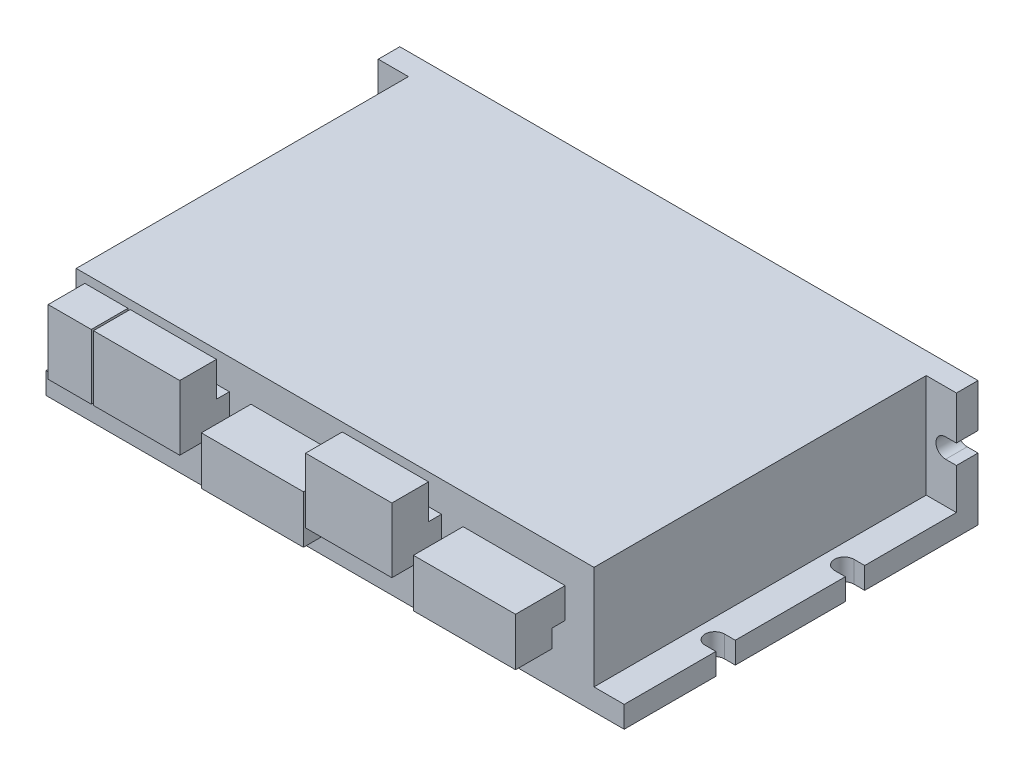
ISO-10303-21;
HEADER;
FILE_DESCRIPTION(('STEP AP214'),'2;1');
FILE_NAME('part.step','',(''),(''),'','','');
FILE_SCHEMA(('AUTOMOTIVE_DESIGN { 1 0 10303 214 1 1 1 1 }'));
ENDSEC;
DATA;
#1=APPLICATION_CONTEXT('core data for automotive mechanical design processes');
#2=APPLICATION_PROTOCOL_DEFINITION('international standard','automotive_design',2000,#1);
#3=PRODUCT_CONTEXT('',#1,'mechanical');
#4=PRODUCT('Part','Part','',(#3));
#5=PRODUCT_RELATED_PRODUCT_CATEGORY('part','',(#4));
#6=PRODUCT_DEFINITION_FORMATION('','',#4);
#7=PRODUCT_DEFINITION_CONTEXT('part definition',#1,'design');
#8=PRODUCT_DEFINITION('design','',#6,#7);
#9=PRODUCT_DEFINITION_SHAPE('','',#8);
#10=(LENGTH_UNIT() NAMED_UNIT(*) SI_UNIT(.MILLI.,.METRE.));
#11=(NAMED_UNIT(*) PLANE_ANGLE_UNIT() SI_UNIT($,.RADIAN.));
#12=(NAMED_UNIT(*) SI_UNIT($,.STERADIAN.) SOLID_ANGLE_UNIT());
#13=UNCERTAINTY_MEASURE_WITH_UNIT(LENGTH_MEASURE(1.E-05),#10,'distance_accuracy_value','');
#14=(GEOMETRIC_REPRESENTATION_CONTEXT(3) GLOBAL_UNCERTAINTY_ASSIGNED_CONTEXT((#13)) GLOBAL_UNIT_ASSIGNED_CONTEXT((#10,
#11,#12)) REPRESENTATION_CONTEXT('',''));
#15=CARTESIAN_POINT('',(0.,0.,0.));
#16=DIRECTION('',(0.,0.,1.));
#17=DIRECTION('',(1.,0.,0.));
#18=AXIS2_PLACEMENT_3D('',#15,#16,#17);
#19=CARTESIAN_POINT('',(0.,29.,0.));
#20=DIRECTION('',(0.,0.,-1.));
#21=DIRECTION('',(-1.,0.,0.));
#22=AXIS2_PLACEMENT_3D('',#19,#20,#21);
#23=PLANE('',#22);
#24=DIRECTION('',(1.,0.,0.));
#25=VECTOR('',#24,1.);
#26=CARTESIAN_POINT('',(71.16,15.,0.));
#27=LINE('',#26,#25);
#28=CARTESIAN_POINT('',(47.5,15.,0.));
#29=VERTEX_POINT('',#28);
#30=CARTESIAN_POINT('',(71.16,15.,0.));
#31=VERTEX_POINT('',#30);
#32=EDGE_CURVE('E861',#29,#31,#27,.T.);
#33=ORIENTED_EDGE('',*,*,#32,.F.);
#34=DIRECTION('',(0.,-1.,0.));
#35=VECTOR('',#34,1.);
#36=CARTESIAN_POINT('',(47.5,15.,0.));
#37=LINE('',#36,#35);
#38=CARTESIAN_POINT('',(47.5,22.,0.));
#39=VERTEX_POINT('',#38);
#40=EDGE_CURVE('E872',#39,#29,#37,.T.);
#41=ORIENTED_EDGE('',*,*,#40,.F.);
#42=DIRECTION('',(-1.,0.,0.));
#43=VECTOR('',#42,1.);
#44=CARTESIAN_POINT('',(47.5,22.,0.));
#45=LINE('',#44,#43);
#46=CARTESIAN_POINT('',(71.16,22.,0.));
#47=VERTEX_POINT('',#46);
#48=EDGE_CURVE('E1245',#47,#39,#45,.T.);
#49=ORIENTED_EDGE('',*,*,#48,.F.);
#50=DIRECTION('',(0.,1.,0.));
#51=VECTOR('',#50,1.);
#52=CARTESIAN_POINT('',(71.16,22.,0.));
#53=LINE('',#52,#51);
#54=EDGE_CURVE('E1246',#31,#47,#53,.T.);
#55=ORIENTED_EDGE('',*,*,#54,.F.);
#56=EDGE_LOOP('',(#33,#41,#49,#55));
#57=FACE_BOUND('',#56,.T.);
#58=DIRECTION('',(0.,-1.,0.));
#59=VECTOR('',#58,1.);
#60=CARTESIAN_POINT('',(12.,15.,0.));
#61=LINE('',#60,#59);
#62=CARTESIAN_POINT('',(12.,22.,0.));
#63=VERTEX_POINT('',#62);
#64=CARTESIAN_POINT('',(12.,15.,0.));
#65=VERTEX_POINT('',#64);
#66=EDGE_CURVE('E782',#63,#65,#61,.T.);
#67=ORIENTED_EDGE('',*,*,#66,.F.);
#68=DIRECTION('',(-1.,0.,0.));
#69=VECTOR('',#68,1.);
#70=CARTESIAN_POINT('',(12.,22.,0.));
#71=LINE('',#70,#69);
#72=CARTESIAN_POINT('',(22.,22.,0.));
#73=VERTEX_POINT('',#72);
#74=EDGE_CURVE('E775',#73,#63,#71,.T.);
#75=ORIENTED_EDGE('',*,*,#74,.F.);
#76=DIRECTION('',(0.,1.,0.));
#77=VECTOR('',#76,1.);
#78=CARTESIAN_POINT('',(22.,22.,0.));
#79=LINE('',#78,#77);
#80=CARTESIAN_POINT('',(22.,15.,0.));
#81=VERTEX_POINT('',#80);
#82=EDGE_CURVE('E788',#81,#73,#79,.T.);
#83=ORIENTED_EDGE('',*,*,#82,.F.);
#84=DIRECTION('',(1.,0.,0.));
#85=VECTOR('',#84,1.);
#86=CARTESIAN_POINT('',(22.,15.,0.));
#87=LINE('',#86,#85);
#88=EDGE_CURVE('E785',#65,#81,#87,.T.);
#89=ORIENTED_EDGE('',*,*,#88,.F.);
#90=EDGE_LOOP('',(#67,#75,#83,#89));
#91=FACE_BOUND('',#90,.T.);
#92=DIRECTION('',(0.,-1.,0.));
#93=VECTOR('',#92,1.);
#94=CARTESIAN_POINT('',(134.,29.,0.));
#95=LINE('',#94,#93);
#96=CARTESIAN_POINT('',(134.,5.,0.));
#97=VERTEX_POINT('',#96);
#98=CARTESIAN_POINT('',(134.,0.,0.));
#99=VERTEX_POINT('',#98);
#100=EDGE_CURVE('E46',#97,#99,#95,.T.);
#101=ORIENTED_EDGE('',*,*,#100,.F.);
#102=DIRECTION('',(1.,0.,0.));
#103=VECTOR('',#102,1.);
#104=CARTESIAN_POINT('',(134.,5.,0.));
#105=LINE('',#104,#103);
#106=CARTESIAN_POINT('',(127.,5.,0.));
#107=VERTEX_POINT('',#106);
#108=EDGE_CURVE('E693',#107,#97,#105,.T.);
#109=ORIENTED_EDGE('',*,*,#108,.F.);
#110=DIRECTION('',(0.,-1.,0.));
#111=VECTOR('',#110,1.);
#112=CARTESIAN_POINT('',(127.,29.,0.));
#113=LINE('',#112,#111);
#114=CARTESIAN_POINT('',(127.,29.,0.));
#115=VERTEX_POINT('',#114);
#116=EDGE_CURVE('E676',#115,#107,#113,.T.);
#117=ORIENTED_EDGE('',*,*,#116,.F.);
#118=DIRECTION('',(1.,0.,0.));
#119=VECTOR('',#118,1.);
#120=CARTESIAN_POINT('',(0.,29.,0.));
#121=LINE('',#120,#119);
#122=CARTESIAN_POINT('',(7.,29.,0.));
#123=VERTEX_POINT('',#122);
#124=EDGE_CURVE('E734',#123,#115,#121,.T.);
#125=ORIENTED_EDGE('',*,*,#124,.F.);
#126=DIRECTION('',(0.,1.,0.));
#127=VECTOR('',#126,1.);
#128=CARTESIAN_POINT('',(7.,29.,0.));
#129=LINE('',#128,#127);
#130=CARTESIAN_POINT('',(7.,5.,0.));
#131=VERTEX_POINT('',#130);
#132=EDGE_CURVE('E719',#131,#123,#129,.T.);
#133=ORIENTED_EDGE('',*,*,#132,.F.);
#134=DIRECTION('',(1.,0.,0.));
#135=VECTOR('',#134,1.);
#136=CARTESIAN_POINT('',(0.,5.,0.));
#137=LINE('',#136,#135);
#138=CARTESIAN_POINT('',(0.,5.,0.));
#139=VERTEX_POINT('',#138);
#140=EDGE_CURVE('E699',#139,#131,#137,.T.);
#141=ORIENTED_EDGE('',*,*,#140,.F.);
#142=DIRECTION('',(0.,-1.,0.));
#143=VECTOR('',#142,1.);
#144=CARTESIAN_POINT('',(0.,29.,0.));
#145=LINE('',#144,#143);
#146=CARTESIAN_POINT('',(0.,0.,0.));
#147=VERTEX_POINT('',#146);
#148=EDGE_CURVE('E11',#139,#147,#145,.T.);
#149=ORIENTED_EDGE('',*,*,#148,.T.);
#150=DIRECTION('',(1.,0.,0.));
#151=VECTOR('',#150,1.);
#152=CARTESIAN_POINT('',(0.,0.,0.));
#153=LINE('',#152,#151);
#154=EDGE_CURVE('E746',#147,#99,#153,.T.);
#155=ORIENTED_EDGE('',*,*,#154,.T.);
#156=EDGE_LOOP('',(#101,#109,#117,#125,#133,#141,#149,#155));
#157=FACE_BOUND('',#156,.T.);
#158=DIRECTION('',(0.,1.,0.));
#159=VECTOR('',#158,1.);
#160=CARTESIAN_POINT('',(120.32,15.,0.));
#161=LINE('',#160,#159);
#162=CARTESIAN_POINT('',(120.32,15.,0.));
#163=VERTEX_POINT('',#162);
#164=CARTESIAN_POINT('',(120.32,22.,0.));
#165=VERTEX_POINT('',#164);
#166=EDGE_CURVE('E510',#163,#165,#161,.T.);
#167=ORIENTED_EDGE('',*,*,#166,.F.);
#168=DIRECTION('',(1.,0.,0.));
#169=VECTOR('',#168,1.);
#170=CARTESIAN_POINT('',(96.66,15.,0.));
#171=LINE('',#170,#169);
#172=CARTESIAN_POINT('',(96.66,15.,0.));
#173=VERTEX_POINT('',#172);
#174=EDGE_CURVE('E495',#173,#163,#171,.T.);
#175=ORIENTED_EDGE('',*,*,#174,.F.);
#176=DIRECTION('',(0.,-1.,0.));
#177=VECTOR('',#176,1.);
#178=CARTESIAN_POINT('',(96.66,15.,0.));
#179=LINE('',#178,#177);
#180=CARTESIAN_POINT('',(96.66,22.,0.));
#181=VERTEX_POINT('',#180);
#182=EDGE_CURVE('E500',#181,#173,#179,.T.);
#183=ORIENTED_EDGE('',*,*,#182,.F.);
#184=DIRECTION('',(-1.,0.,0.));
#185=VECTOR('',#184,1.);
#186=CARTESIAN_POINT('',(96.66,22.,0.));
#187=LINE('',#186,#185);
#188=EDGE_CURVE('E512',#165,#181,#187,.T.);
#189=ORIENTED_EDGE('',*,*,#188,.F.);
#190=EDGE_LOOP('',(#167,#175,#183,#189));
#191=FACE_BOUND('',#190,.T.);
#192=DIRECTION('',(0.,-1.,0.));
#193=VECTOR('',#192,1.);
#194=CARTESIAN_POINT('',(22.5,15.,0.));
#195=LINE('',#194,#193);
#196=CARTESIAN_POINT('',(22.5,22.,0.));
#197=VERTEX_POINT('',#196);
#198=CARTESIAN_POINT('',(22.5,15.,0.));
#199=VERTEX_POINT('',#198);
#200=EDGE_CURVE('E896',#197,#199,#195,.T.);
#201=ORIENTED_EDGE('',*,*,#200,.F.);
#202=DIRECTION('',(-1.,0.,0.));
#203=VECTOR('',#202,1.);
#204=CARTESIAN_POINT('',(22.5,22.,0.));
#205=LINE('',#204,#203);
#206=CARTESIAN_POINT('',(42.5,22.,0.));
#207=VERTEX_POINT('',#206);
#208=EDGE_CURVE('E904',#207,#197,#205,.T.);
#209=ORIENTED_EDGE('',*,*,#208,.F.);
#210=DIRECTION('',(0.,1.,0.));
#211=VECTOR('',#210,1.);
#212=CARTESIAN_POINT('',(42.5,15.,0.));
#213=LINE('',#212,#211);
#214=CARTESIAN_POINT('',(42.5,15.,0.));
#215=VERTEX_POINT('',#214);
#216=EDGE_CURVE('E931',#215,#207,#213,.T.);
#217=ORIENTED_EDGE('',*,*,#216,.F.);
#218=DIRECTION('',(1.,0.,0.));
#219=VECTOR('',#218,1.);
#220=CARTESIAN_POINT('',(22.5,15.,0.));
#221=LINE('',#220,#219);
#222=EDGE_CURVE('E927',#199,#215,#221,.T.);
#223=ORIENTED_EDGE('',*,*,#222,.F.);
#224=EDGE_LOOP('',(#201,#209,#217,#223));
#225=FACE_BOUND('',#224,.T.);
#226=DIRECTION('',(1.,0.,0.));
#227=VECTOR('',#226,1.);
#228=CARTESIAN_POINT('',(71.66,15.,0.));
#229=LINE('',#228,#227);
#230=CARTESIAN_POINT('',(71.66,15.,0.));
#231=VERTEX_POINT('',#230);
#232=CARTESIAN_POINT('',(91.66,15.,0.));
#233=VERTEX_POINT('',#232);
#234=EDGE_CURVE('E843',#231,#233,#229,.T.);
#235=ORIENTED_EDGE('',*,*,#234,.F.);
#236=DIRECTION('',(0.,-1.,0.));
#237=VECTOR('',#236,1.);
#238=CARTESIAN_POINT('',(71.66,22.,0.));
#239=LINE('',#238,#237);
#240=CARTESIAN_POINT('',(71.66,22.,0.));
#241=VERTEX_POINT('',#240);
#242=EDGE_CURVE('E852',#241,#231,#239,.T.);
#243=ORIENTED_EDGE('',*,*,#242,.F.);
#244=DIRECTION('',(-1.,0.,0.));
#245=VECTOR('',#244,1.);
#246=CARTESIAN_POINT('',(91.66,22.,0.));
#247=LINE('',#246,#245);
#248=CARTESIAN_POINT('',(91.66,22.,0.));
#249=VERTEX_POINT('',#248);
#250=EDGE_CURVE('E59',#249,#241,#247,.T.);
#251=ORIENTED_EDGE('',*,*,#250,.F.);
#252=DIRECTION('',(0.,1.,0.));
#253=VECTOR('',#252,1.);
#254=CARTESIAN_POINT('',(91.66,15.,0.));
#255=LINE('',#254,#253);
#256=EDGE_CURVE('E54',#233,#249,#255,.T.);
#257=ORIENTED_EDGE('',*,*,#256,.F.);
#258=EDGE_LOOP('',(#235,#243,#251,#257));
#259=FACE_BOUND('',#258,.T.);
#260=ADVANCED_FACE('F37',(#57,#91,#157,#191,#225,#259),#23,.F.);
#261=CARTESIAN_POINT('',(134.,29.,0.));
#262=DIRECTION('',(-1.,0.,0.));
#263=DIRECTION('',(0.,0.,1.));
#264=AXIS2_PLACEMENT_3D('',#261,#262,#263);
#265=PLANE('',#264);
#266=DIRECTION('',(0.,1.,0.));
#267=VECTOR('',#266,1.);
#268=CARTESIAN_POINT('',(134.,29.,-77.));
#269=LINE('',#268,#267);
#270=CARTESIAN_POINT('',(134.,18.95,-77.));
#271=VERTEX_POINT('',#270);
#272=CARTESIAN_POINT('',(134.,29.,-77.));
#273=VERTEX_POINT('',#272);
#274=EDGE_CURVE('E681',#271,#273,#269,.T.);
#275=ORIENTED_EDGE('',*,*,#274,.F.);
#276=DIRECTION('',(0.,0.,1.));
#277=VECTOR('',#276,1.);
#278=CARTESIAN_POINT('',(134.,18.95,-82.));
#279=LINE('',#278,#277);
#280=CARTESIAN_POINT('',(134.,18.95,-82.));
#281=VERTEX_POINT('',#280);
#282=EDGE_CURVE('E541',#281,#271,#279,.T.);
#283=ORIENTED_EDGE('',*,*,#282,.F.);
#284=DIRECTION('',(0.,-1.,0.));
#285=VECTOR('',#284,1.);
#286=CARTESIAN_POINT('',(134.,29.,-82.));
#287=LINE('',#286,#285);
#288=CARTESIAN_POINT('',(134.,29.,-82.));
#289=VERTEX_POINT('',#288);
#290=EDGE_CURVE('E761',#289,#281,#287,.T.);
#291=ORIENTED_EDGE('',*,*,#290,.F.);
#292=DIRECTION('',(0.,0.,-1.));
#293=VECTOR('',#292,1.);
#294=CARTESIAN_POINT('',(134.,29.,0.));
#295=LINE('',#294,#293);
#296=EDGE_CURVE('E738',#273,#289,#295,.T.);
#297=ORIENTED_EDGE('',*,*,#296,.F.);
#298=EDGE_LOOP('',(#275,#283,#291,#297));
#299=FACE_BOUND('',#298,.T.);
#300=ADVANCED_FACE('F999',(#299),#265,.F.);
#301=CARTESIAN_POINT('',(0.,29.,0.));
#302=DIRECTION('',(1.,0.,0.));
#303=DIRECTION('',(0.,0.,-1.));
#304=AXIS2_PLACEMENT_3D('',#301,#302,#303);
#305=PLANE('',#304);
#306=DIRECTION('',(0.,-1.,0.));
#307=VECTOR('',#306,1.);
#308=CARTESIAN_POINT('',(0.,29.,-82.));
#309=LINE('',#308,#307);
#310=CARTESIAN_POINT('',(0.,29.,-82.));
#311=VERTEX_POINT('',#310);
#312=CARTESIAN_POINT('',(0.,18.95,-82.));
#313=VERTEX_POINT('',#312);
#314=EDGE_CURVE('E757',#311,#313,#309,.T.);
#315=ORIENTED_EDGE('',*,*,#314,.T.);
#316=DIRECTION('',(0.,0.,1.));
#317=VECTOR('',#316,1.);
#318=CARTESIAN_POINT('',(0.,18.95,-82.));
#319=LINE('',#318,#317);
#320=CARTESIAN_POINT('',(0.,18.95,-77.));
#321=VERTEX_POINT('',#320);
#322=EDGE_CURVE('E565',#313,#321,#319,.T.);
#323=ORIENTED_EDGE('',*,*,#322,.T.);
#324=DIRECTION('',(0.,-1.,0.));
#325=VECTOR('',#324,1.);
#326=CARTESIAN_POINT('',(0.,29.,-77.));
#327=LINE('',#326,#325);
#328=CARTESIAN_POINT('',(0.,29.,-77.));
#329=VERTEX_POINT('',#328);
#330=EDGE_CURVE('E705',#329,#321,#327,.T.);
#331=ORIENTED_EDGE('',*,*,#330,.F.);
#332=DIRECTION('',(0.,0.,1.));
#333=VECTOR('',#332,1.);
#334=CARTESIAN_POINT('',(0.,29.,0.));
#335=LINE('',#334,#333);
#336=EDGE_CURVE('E731',#311,#329,#335,.T.);
#337=ORIENTED_EDGE('',*,*,#336,.F.);
#338=EDGE_LOOP('',(#315,#323,#331,#337));
#339=FACE_BOUND('',#338,.T.);
#340=ADVANCED_FACE('F1006',(#339),#305,.F.);
#341=CARTESIAN_POINT('',(0.,0.,0.));
#342=DIRECTION('',(0.,-1.,0.));
#343=DIRECTION('',(0.,0.,-1.));
#344=AXIS2_PLACEMENT_3D('',#341,#342,#343);
#345=PLANE('',#344);
#346=CARTESIAN_POINT('',(131.5,0.,-23.5));
#347=DIRECTION('',(0.,1.,0.));
#348=DIRECTION('',(0.,0.,1.));
#349=AXIS2_PLACEMENT_3D('',#346,#347,#348);
#350=CIRCLE('',#349,2.25);
#351=CARTESIAN_POINT('',(131.5,0.,-25.75));
#352=VERTEX_POINT('',#351);
#353=CARTESIAN_POINT('',(131.5,0.,-21.25));
#354=VERTEX_POINT('',#353);
#355=EDGE_CURVE('E568',#352,#354,#350,.T.);
#356=ORIENTED_EDGE('',*,*,#355,.T.);
#357=DIRECTION('',(1.,0.,0.));
#358=VECTOR('',#357,1.);
#359=CARTESIAN_POINT('',(131.5,0.,-21.25));
#360=LINE('',#359,#358);
#361=CARTESIAN_POINT('',(134.,0.,-21.25));
#362=VERTEX_POINT('',#361);
#363=EDGE_CURVE('E584',#354,#362,#360,.T.);
#364=ORIENTED_EDGE('',*,*,#363,.T.);
#365=DIRECTION('',(0.,0.,-1.));
#366=VECTOR('',#365,1.);
#367=CARTESIAN_POINT('',(134.,0.,0.));
#368=LINE('',#367,#366);
#369=EDGE_CURVE('E751',#99,#362,#368,.T.);
#370=ORIENTED_EDGE('',*,*,#369,.F.);
#371=ORIENTED_EDGE('',*,*,#154,.F.);
#372=DIRECTION('',(0.,0.,1.));
#373=VECTOR('',#372,1.);
#374=CARTESIAN_POINT('',(0.,0.,0.));
#375=LINE('',#374,#373);
#376=CARTESIAN_POINT('',(0.,0.,-21.25));
#377=VERTEX_POINT('',#376);
#378=EDGE_CURVE('E724',#377,#147,#375,.T.);
#379=ORIENTED_EDGE('',*,*,#378,.F.);
#380=DIRECTION('',(1.,0.,0.));
#381=VECTOR('',#380,1.);
#382=CARTESIAN_POINT('',(2.5,0.,-21.25));
#383=LINE('',#382,#381);
#384=CARTESIAN_POINT('',(2.5,0.,-21.25));
#385=VERTEX_POINT('',#384);
#386=EDGE_CURVE('E649',#377,#385,#383,.T.);
#387=ORIENTED_EDGE('',*,*,#386,.T.);
#388=CARTESIAN_POINT('',(2.5,0.,-23.5));
#389=DIRECTION('',(0.,1.,0.));
#390=DIRECTION('',(0.,0.,-1.));
#391=AXIS2_PLACEMENT_3D('',#388,#389,#390);
#392=CIRCLE('',#391,2.25);
#393=CARTESIAN_POINT('',(2.5,0.,-25.75));
#394=VERTEX_POINT('',#393);
#395=EDGE_CURVE('E662',#385,#394,#392,.T.);
#396=ORIENTED_EDGE('',*,*,#395,.T.);
#397=DIRECTION('',(-1.,0.,0.));
#398=VECTOR('',#397,1.);
#399=CARTESIAN_POINT('',(2.5,0.,-25.75));
#400=LINE('',#399,#398);
#401=CARTESIAN_POINT('',(0.,0.,-25.75));
#402=VERTEX_POINT('',#401);
#403=EDGE_CURVE('E653',#394,#402,#400,.T.);
#404=ORIENTED_EDGE('',*,*,#403,.T.);
#405=CARTESIAN_POINT('',(0.,0.,-51.25));
#406=VERTEX_POINT('',#405);
#407=EDGE_CURVE('E747',#406,#402,#375,.T.);
#408=ORIENTED_EDGE('',*,*,#407,.F.);
#409=DIRECTION('',(1.,0.,0.));
#410=VECTOR('',#409,1.);
#411=CARTESIAN_POINT('',(2.50000000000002,0.,-51.25));
#412=LINE('',#411,#410);
#413=CARTESIAN_POINT('',(2.50000000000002,0.,-51.25));
#414=VERTEX_POINT('',#413);
#415=EDGE_CURVE('E628',#406,#414,#412,.T.);
#416=ORIENTED_EDGE('',*,*,#415,.T.);
#417=CARTESIAN_POINT('',(2.50000000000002,0.,-53.5));
#418=DIRECTION('',(0.,1.,0.));
#419=DIRECTION('',(0.,0.,-1.));
#420=AXIS2_PLACEMENT_3D('',#417,#418,#419);
#421=CIRCLE('',#420,2.25);
#422=CARTESIAN_POINT('',(2.50000000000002,0.,-55.75));
#423=VERTEX_POINT('',#422);
#424=EDGE_CURVE('E624',#414,#423,#421,.T.);
#425=ORIENTED_EDGE('',*,*,#424,.T.);
#426=DIRECTION('',(-1.,0.,0.));
#427=VECTOR('',#426,1.);
#428=CARTESIAN_POINT('',(2.50000000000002,0.,-55.75));
#429=LINE('',#428,#427);
#430=CARTESIAN_POINT('',(0.,0.,-55.75));
#431=VERTEX_POINT('',#430);
#432=EDGE_CURVE('E635',#423,#431,#429,.T.);
#433=ORIENTED_EDGE('',*,*,#432,.T.);
#434=CARTESIAN_POINT('',(0.,0.,-82.));
#435=VERTEX_POINT('',#434);
#436=EDGE_CURVE('E743',#435,#431,#375,.T.);
#437=ORIENTED_EDGE('',*,*,#436,.F.);
#438=DIRECTION('',(-1.,0.,0.));
#439=VECTOR('',#438,1.);
#440=CARTESIAN_POINT('',(0.,0.,-82.));
#441=LINE('',#440,#439);
#442=CARTESIAN_POINT('',(134.,0.,-82.));
#443=VERTEX_POINT('',#442);
#444=EDGE_CURVE('E735',#443,#435,#441,.T.);
#445=ORIENTED_EDGE('',*,*,#444,.F.);
#446=CARTESIAN_POINT('',(134.,0.,-55.75));
#447=VERTEX_POINT('',#446);
#448=EDGE_CURVE('E750',#447,#443,#368,.T.);
#449=ORIENTED_EDGE('',*,*,#448,.F.);
#450=DIRECTION('',(-1.,0.,0.));
#451=VECTOR('',#450,1.);
#452=CARTESIAN_POINT('',(131.5,0.,-55.75));
#453=LINE('',#452,#451);
#454=CARTESIAN_POINT('',(131.5,0.,-55.75));
#455=VERTEX_POINT('',#454);
#456=EDGE_CURVE('E602',#447,#455,#453,.T.);
#457=ORIENTED_EDGE('',*,*,#456,.T.);
#458=CARTESIAN_POINT('',(131.5,0.,-53.5));
#459=DIRECTION('',(0.,1.,0.));
#460=DIRECTION('',(0.,0.,1.));
#461=AXIS2_PLACEMENT_3D('',#458,#459,#460);
#462=CIRCLE('',#461,2.25);
#463=CARTESIAN_POINT('',(131.5,0.,-51.25));
#464=VERTEX_POINT('',#463);
#465=EDGE_CURVE('E598',#455,#464,#462,.T.);
#466=ORIENTED_EDGE('',*,*,#465,.T.);
#467=DIRECTION('',(1.,0.,0.));
#468=VECTOR('',#467,1.);
#469=CARTESIAN_POINT('',(131.5,0.,-51.25));
#470=LINE('',#469,#468);
#471=CARTESIAN_POINT('',(134.,0.,-51.25));
#472=VERTEX_POINT('',#471);
#473=EDGE_CURVE('E609',#464,#472,#470,.T.);
#474=ORIENTED_EDGE('',*,*,#473,.T.);
#475=CARTESIAN_POINT('',(134.,0.,-25.75));
#476=VERTEX_POINT('',#475);
#477=EDGE_CURVE('E754',#476,#472,#368,.T.);
#478=ORIENTED_EDGE('',*,*,#477,.F.);
#479=DIRECTION('',(-1.,0.,0.));
#480=VECTOR('',#479,1.);
#481=CARTESIAN_POINT('',(131.5,0.,-25.75));
#482=LINE('',#481,#480);
#483=EDGE_CURVE('E577',#476,#352,#482,.T.);
#484=ORIENTED_EDGE('',*,*,#483,.T.);
#485=EDGE_LOOP('',(#356,#364,#370,#371,#379,#387,#396,#404,#408,#416,#425,#433,#437,#445,#449,
#457,#466,#474,#478,#484));
#486=FACE_BOUND('',#485,.T.);
#487=ADVANCED_FACE('F1013',(#486),#345,.T.);
#488=DIRECTION('',(0.,-1.,0.));
#489=VECTOR('',#488,1.);
#490=CARTESIAN_POINT('',(134.,5.,-21.25));
#491=LINE('',#490,#489);
#492=CARTESIAN_POINT('',(134.,5.,-21.25));
#493=VERTEX_POINT('',#492);
#494=EDGE_CURVE('E593',#493,#362,#491,.T.);
#495=ORIENTED_EDGE('',*,*,#494,.F.);
#496=DIRECTION('',(0.,0.,1.));
#497=VECTOR('',#496,1.);
#498=CARTESIAN_POINT('',(134.,5.,-77.));
#499=LINE('',#498,#497);
#500=EDGE_CURVE('E701',#493,#97,#499,.T.);
#501=ORIENTED_EDGE('',*,*,#500,.T.);
#502=ORIENTED_EDGE('',*,*,#100,.T.);
#503=ORIENTED_EDGE('',*,*,#369,.T.);
#504=EDGE_LOOP('',(#495,#501,#502,#503));
#505=FACE_BOUND('',#504,.T.);
#506=ADVANCED_FACE('F1010',(#505),#265,.F.);
#507=DIRECTION('',(0.,-1.,0.));
#508=VECTOR('',#507,1.);
#509=CARTESIAN_POINT('',(134.,5.,-25.75));
#510=LINE('',#509,#508);
#511=CARTESIAN_POINT('',(134.,5.,-25.75));
#512=VERTEX_POINT('',#511);
#513=EDGE_CURVE('E590',#512,#476,#510,.T.);
#514=ORIENTED_EDGE('',*,*,#513,.T.);
#515=ORIENTED_EDGE('',*,*,#477,.T.);
#516=DIRECTION('',(0.,-1.,0.));
#517=VECTOR('',#516,1.);
#518=CARTESIAN_POINT('',(134.,5.,-51.25));
#519=LINE('',#518,#517);
#520=CARTESIAN_POINT('',(134.,5.,-51.25));
#521=VERTEX_POINT('',#520);
#522=EDGE_CURVE('E618',#521,#472,#519,.T.);
#523=ORIENTED_EDGE('',*,*,#522,.F.);
#524=EDGE_CURVE('E700',#521,#512,#499,.T.);
#525=ORIENTED_EDGE('',*,*,#524,.T.);
#526=EDGE_LOOP('',(#514,#515,#523,#525));
#527=FACE_BOUND('',#526,.T.);
#528=ADVANCED_FACE('F1009',(#527),#265,.F.);
#529=CARTESIAN_POINT('',(134.,5.,-77.));
#530=DIRECTION('',(0.,-1.,0.));
#531=DIRECTION('',(0.,0.,-1.));
#532=AXIS2_PLACEMENT_3D('',#529,#530,#531);
#533=PLANE('',#532);
#534=DIRECTION('',(1.,0.,0.));
#535=VECTOR('',#534,1.);
#536=CARTESIAN_POINT('',(131.5,5.,-21.25));
#537=LINE('',#536,#535);
#538=CARTESIAN_POINT('',(131.5,5.,-21.25));
#539=VERTEX_POINT('',#538);
#540=EDGE_CURVE('E576',#539,#493,#537,.T.);
#541=ORIENTED_EDGE('',*,*,#540,.F.);
#542=CARTESIAN_POINT('',(131.5,5.,-23.5));
#543=DIRECTION('',(0.,1.,0.));
#544=DIRECTION('',(0.,0.,1.));
#545=AXIS2_PLACEMENT_3D('',#542,#543,#544);
#546=CIRCLE('',#545,2.25);
#547=CARTESIAN_POINT('',(131.5,5.,-25.75));
#548=VERTEX_POINT('',#547);
#549=EDGE_CURVE('E574',#548,#539,#546,.T.);
#550=ORIENTED_EDGE('',*,*,#549,.F.);
#551=DIRECTION('',(-1.,0.,0.));
#552=VECTOR('',#551,1.);
#553=CARTESIAN_POINT('',(131.5,5.,-25.75));
#554=LINE('',#553,#552);
#555=EDGE_CURVE('E579',#512,#548,#554,.T.);
#556=ORIENTED_EDGE('',*,*,#555,.F.);
#557=ORIENTED_EDGE('',*,*,#524,.F.);
#558=DIRECTION('',(1.,0.,0.));
#559=VECTOR('',#558,1.);
#560=CARTESIAN_POINT('',(131.5,5.,-51.25));
#561=LINE('',#560,#559);
#562=CARTESIAN_POINT('',(131.5,5.,-51.25));
#563=VERTEX_POINT('',#562);
#564=EDGE_CURVE('E601',#563,#521,#561,.T.);
#565=ORIENTED_EDGE('',*,*,#564,.F.);
#566=CARTESIAN_POINT('',(131.5,5.,-53.5));
#567=DIRECTION('',(0.,1.,0.));
#568=DIRECTION('',(0.,0.,1.));
#569=AXIS2_PLACEMENT_3D('',#566,#567,#568);
#570=CIRCLE('',#569,2.25);
#571=CARTESIAN_POINT('',(131.5,5.,-55.75));
#572=VERTEX_POINT('',#571);
#573=EDGE_CURVE('E599',#572,#563,#570,.T.);
#574=ORIENTED_EDGE('',*,*,#573,.F.);
#575=DIRECTION('',(-1.,0.,0.));
#576=VECTOR('',#575,1.);
#577=CARTESIAN_POINT('',(131.5,5.,-55.75));
#578=LINE('',#577,#576);
#579=CARTESIAN_POINT('',(134.,5.,-55.75));
#580=VERTEX_POINT('',#579);
#581=EDGE_CURVE('E604',#580,#572,#578,.T.);
#582=ORIENTED_EDGE('',*,*,#581,.F.);
#583=CARTESIAN_POINT('',(134.,5.,-77.));
#584=VERTEX_POINT('',#583);
#585=EDGE_CURVE('E696',#584,#580,#499,.T.);
#586=ORIENTED_EDGE('',*,*,#585,.F.);
#587=DIRECTION('',(1.,0.,0.));
#588=VECTOR('',#587,1.);
#589=CARTESIAN_POINT('',(134.,5.,-77.));
#590=LINE('',#589,#588);
#591=CARTESIAN_POINT('',(127.,5.,-77.));
#592=VERTEX_POINT('',#591);
#593=EDGE_CURVE('E687',#592,#584,#590,.T.);
#594=ORIENTED_EDGE('',*,*,#593,.F.);
#595=DIRECTION('',(0.,0.,1.));
#596=VECTOR('',#595,1.);
#597=CARTESIAN_POINT('',(127.,5.,-77.));
#598=LINE('',#597,#596);
#599=EDGE_CURVE('E702',#592,#107,#598,.T.);
#600=ORIENTED_EDGE('',*,*,#599,.T.);
#601=ORIENTED_EDGE('',*,*,#108,.T.);
#602=ORIENTED_EDGE('',*,*,#500,.F.);
#603=EDGE_LOOP('',(#541,#550,#556,#557,#565,#574,#582,#586,#594,#600,#601,#602));
#604=FACE_BOUND('',#603,.T.);
#605=ADVANCED_FACE('F1045',(#604),#533,.F.);
#606=CARTESIAN_POINT('',(134.,14.45,-82.));
#607=VERTEX_POINT('',#606);
#608=EDGE_CURVE('E760',#607,#443,#287,.T.);
#609=ORIENTED_EDGE('',*,*,#608,.F.);
#610=DIRECTION('',(0.,0.,1.));
#611=VECTOR('',#610,1.);
#612=CARTESIAN_POINT('',(134.,14.45,-82.));
#613=LINE('',#612,#611);
#614=CARTESIAN_POINT('',(134.,14.45,-77.));
#615=VERTEX_POINT('',#614);
#616=EDGE_CURVE('E543',#607,#615,#613,.T.);
#617=ORIENTED_EDGE('',*,*,#616,.T.);
#618=EDGE_CURVE('E677',#584,#615,#269,.T.);
#619=ORIENTED_EDGE('',*,*,#618,.F.);
#620=ORIENTED_EDGE('',*,*,#585,.T.);
#621=DIRECTION('',(0.,-1.,0.));
#622=VECTOR('',#621,1.);
#623=CARTESIAN_POINT('',(134.,5.,-55.75));
#624=LINE('',#623,#622);
#625=EDGE_CURVE('E615',#580,#447,#624,.T.);
#626=ORIENTED_EDGE('',*,*,#625,.T.);
#627=ORIENTED_EDGE('',*,*,#448,.T.);
#628=EDGE_LOOP('',(#609,#617,#619,#620,#626,#627));
#629=FACE_BOUND('',#628,.T.);
#630=ADVANCED_FACE('F1015',(#629),#265,.F.);
#631=CARTESIAN_POINT('',(0.,14.45,-77.));
#632=VERTEX_POINT('',#631);
#633=CARTESIAN_POINT('',(0.,5.,-77.));
#634=VERTEX_POINT('',#633);
#635=EDGE_CURVE('E709',#632,#634,#327,.T.);
#636=ORIENTED_EDGE('',*,*,#635,.F.);
#637=DIRECTION('',(0.,0.,1.));
#638=VECTOR('',#637,1.);
#639=CARTESIAN_POINT('',(0.,14.45,-82.));
#640=LINE('',#639,#638);
#641=CARTESIAN_POINT('',(0.,14.45,-82.));
#642=VERTEX_POINT('',#641);
#643=EDGE_CURVE('E558',#642,#632,#640,.T.);
#644=ORIENTED_EDGE('',*,*,#643,.F.);
#645=EDGE_CURVE('E742',#642,#435,#309,.T.);
#646=ORIENTED_EDGE('',*,*,#645,.T.);
#647=ORIENTED_EDGE('',*,*,#436,.T.);
#648=DIRECTION('',(0.,-1.,0.));
#649=VECTOR('',#648,1.);
#650=CARTESIAN_POINT('',(0.,5.,-55.75));
#651=LINE('',#650,#649);
#652=CARTESIAN_POINT('',(0.,5.,-55.75));
#653=VERTEX_POINT('',#652);
#654=EDGE_CURVE('E644',#653,#431,#651,.T.);
#655=ORIENTED_EDGE('',*,*,#654,.F.);
#656=DIRECTION('',(0.,0.,1.));
#657=VECTOR('',#656,1.);
#658=CARTESIAN_POINT('',(0.,5.,-77.));
#659=LINE('',#658,#657);
#660=EDGE_CURVE('E727',#634,#653,#659,.T.);
#661=ORIENTED_EDGE('',*,*,#660,.F.);
#662=EDGE_LOOP('',(#636,#644,#646,#647,#655,#661));
#663=FACE_BOUND('',#662,.T.);
#664=ADVANCED_FACE('F1645',(#663),#305,.F.);
#665=DIRECTION('',(0.,-1.,0.));
#666=VECTOR('',#665,1.);
#667=CARTESIAN_POINT('',(0.,5.,-51.25));
#668=LINE('',#667,#666);
#669=CARTESIAN_POINT('',(0.,5.,-51.25));
#670=VERTEX_POINT('',#669);
#671=EDGE_CURVE('E641',#670,#406,#668,.T.);
#672=ORIENTED_EDGE('',*,*,#671,.T.);
#673=ORIENTED_EDGE('',*,*,#407,.T.);
#674=DIRECTION('',(0.,-1.,0.));
#675=VECTOR('',#674,1.);
#676=CARTESIAN_POINT('',(0.,5.,-25.75));
#677=LINE('',#676,#675);
#678=CARTESIAN_POINT('',(0.,5.,-25.75));
#679=VERTEX_POINT('',#678);
#680=EDGE_CURVE('E659',#679,#402,#677,.T.);
#681=ORIENTED_EDGE('',*,*,#680,.F.);
#682=EDGE_CURVE('E730',#670,#679,#659,.T.);
#683=ORIENTED_EDGE('',*,*,#682,.F.);
#684=EDGE_LOOP('',(#672,#673,#681,#683));
#685=FACE_BOUND('',#684,.T.);
#686=ADVANCED_FACE('F1031',(#685),#305,.F.);
#687=CARTESIAN_POINT('',(0.,5.,-77.));
#688=DIRECTION('',(0.,-1.,0.));
#689=DIRECTION('',(0.,0.,-1.));
#690=AXIS2_PLACEMENT_3D('',#687,#688,#689);
#691=PLANE('',#690);
#692=DIRECTION('',(-1.,0.,0.));
#693=VECTOR('',#692,1.);
#694=CARTESIAN_POINT('',(2.50000000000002,5.,-55.75));
#695=LINE('',#694,#693);
#696=CARTESIAN_POINT('',(2.50000000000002,5.,-55.75));
#697=VERTEX_POINT('',#696);
#698=EDGE_CURVE('E627',#697,#653,#695,.T.);
#699=ORIENTED_EDGE('',*,*,#698,.F.);
#700=CARTESIAN_POINT('',(2.50000000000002,5.,-53.5));
#701=DIRECTION('',(0.,1.,0.));
#702=DIRECTION('',(0.,0.,-1.));
#703=AXIS2_PLACEMENT_3D('',#700,#701,#702);
#704=CIRCLE('',#703,2.25);
#705=CARTESIAN_POINT('',(2.50000000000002,5.,-51.25));
#706=VERTEX_POINT('',#705);
#707=EDGE_CURVE('E625',#706,#697,#704,.T.);
#708=ORIENTED_EDGE('',*,*,#707,.F.);
#709=DIRECTION('',(1.,0.,0.));
#710=VECTOR('',#709,1.);
#711=CARTESIAN_POINT('',(2.50000000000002,5.,-51.25));
#712=LINE('',#711,#710);
#713=EDGE_CURVE('E630',#670,#706,#712,.T.);
#714=ORIENTED_EDGE('',*,*,#713,.F.);
#715=ORIENTED_EDGE('',*,*,#682,.T.);
#716=DIRECTION('',(-1.,0.,0.));
#717=VECTOR('',#716,1.);
#718=CARTESIAN_POINT('',(2.5,5.,-25.75));
#719=LINE('',#718,#717);
#720=CARTESIAN_POINT('',(2.5,5.,-25.75));
#721=VERTEX_POINT('',#720);
#722=EDGE_CURVE('E656',#721,#679,#719,.T.);
#723=ORIENTED_EDGE('',*,*,#722,.F.);
#724=CARTESIAN_POINT('',(2.5,5.,-23.5));
#725=DIRECTION('',(0.,1.,0.));
#726=DIRECTION('',(0.,0.,-1.));
#727=AXIS2_PLACEMENT_3D('',#724,#725,#726);
#728=CIRCLE('',#727,2.25);
#729=CARTESIAN_POINT('',(2.5,5.,-21.25));
#730=VERTEX_POINT('',#729);
#731=EDGE_CURVE('E652',#730,#721,#728,.T.);
#732=ORIENTED_EDGE('',*,*,#731,.F.);
#733=DIRECTION('',(1.,0.,0.));
#734=VECTOR('',#733,1.);
#735=CARTESIAN_POINT('',(2.5,5.,-21.25));
#736=LINE('',#735,#734);
#737=CARTESIAN_POINT('',(0.,5.,-21.25));
#738=VERTEX_POINT('',#737);
#739=EDGE_CURVE('E650',#738,#730,#736,.T.);
#740=ORIENTED_EDGE('',*,*,#739,.F.);
#741=EDGE_CURVE('E716',#738,#139,#659,.T.);
#742=ORIENTED_EDGE('',*,*,#741,.T.);
#743=ORIENTED_EDGE('',*,*,#140,.T.);
#744=DIRECTION('',(0.,0.,1.));
#745=VECTOR('',#744,1.);
#746=CARTESIAN_POINT('',(7.,5.,-77.));
#747=LINE('',#746,#745);
#748=CARTESIAN_POINT('',(7.,5.,-77.));
#749=VERTEX_POINT('',#748);
#750=EDGE_CURVE('E725',#749,#131,#747,.T.);
#751=ORIENTED_EDGE('',*,*,#750,.F.);
#752=DIRECTION('',(1.,0.,0.));
#753=VECTOR('',#752,1.);
#754=CARTESIAN_POINT('',(0.,5.,-77.));
#755=LINE('',#754,#753);
#756=EDGE_CURVE('E708',#634,#749,#755,.T.);
#757=ORIENTED_EDGE('',*,*,#756,.F.);
#758=ORIENTED_EDGE('',*,*,#660,.T.);
#759=EDGE_LOOP('',(#699,#708,#714,#715,#723,#732,#740,#742,#743,#751,#757,#758));
#760=FACE_BOUND('',#759,.T.);
#761=ADVANCED_FACE('F1028',(#760),#691,.F.);
#762=DIRECTION('',(0.,-1.,0.));
#763=VECTOR('',#762,1.);
#764=CARTESIAN_POINT('',(0.,5.,-21.25));
#765=LINE('',#764,#763);
#766=EDGE_CURVE('E673',#738,#377,#765,.T.);
#767=ORIENTED_EDGE('',*,*,#766,.T.);
#768=ORIENTED_EDGE('',*,*,#378,.T.);
#769=ORIENTED_EDGE('',*,*,#148,.F.);
#770=ORIENTED_EDGE('',*,*,#741,.F.);
#771=EDGE_LOOP('',(#767,#768,#769,#770));
#772=FACE_BOUND('',#771,.T.);
#773=ADVANCED_FACE('F39',(#772),#305,.F.);
#774=CARTESIAN_POINT('',(0.,29.,-82.));
#775=DIRECTION('',(0.,0.,1.));
#776=DIRECTION('',(1.,0.,0.));
#777=AXIS2_PLACEMENT_3D('',#774,#775,#776);
#778=PLANE('',#777);
#779=ORIENTED_EDGE('',*,*,#290,.T.);
#780=DIRECTION('',(-1.,0.,0.));
#781=VECTOR('',#780,1.);
#782=CARTESIAN_POINT('',(131.5,18.95,-82.));
#783=LINE('',#782,#781);
#784=CARTESIAN_POINT('',(131.5,18.95,-82.));
#785=VERTEX_POINT('',#784);
#786=EDGE_CURVE('E529',#281,#785,#783,.T.);
#787=ORIENTED_EDGE('',*,*,#786,.T.);
#788=CARTESIAN_POINT('',(131.5,16.7,-82.));
#789=DIRECTION('',(0.,0.,1.));
#790=DIRECTION('',(1.,0.,0.));
#791=AXIS2_PLACEMENT_3D('',#788,#789,#790);
#792=CIRCLE('',#791,2.25);
#793=CARTESIAN_POINT('',(131.5,14.45,-82.));
#794=VERTEX_POINT('',#793);
#795=EDGE_CURVE('E522',#785,#794,#792,.T.);
#796=ORIENTED_EDGE('',*,*,#795,.T.);
#797=DIRECTION('',(1.,0.,0.));
#798=VECTOR('',#797,1.);
#799=CARTESIAN_POINT('',(131.5,14.45,-82.));
#800=LINE('',#799,#798);
#801=EDGE_CURVE('E525',#794,#607,#800,.T.);
#802=ORIENTED_EDGE('',*,*,#801,.T.);
#803=ORIENTED_EDGE('',*,*,#608,.T.);
#804=ORIENTED_EDGE('',*,*,#444,.T.);
#805=ORIENTED_EDGE('',*,*,#645,.F.);
#806=DIRECTION('',(1.,0.,0.));
#807=VECTOR('',#806,1.);
#808=CARTESIAN_POINT('',(2.5,14.45,-82.));
#809=LINE('',#808,#807);
#810=CARTESIAN_POINT('',(2.5,14.45,-82.));
#811=VERTEX_POINT('',#810);
#812=EDGE_CURVE('E548',#642,#811,#809,.T.);
#813=ORIENTED_EDGE('',*,*,#812,.T.);
#814=CARTESIAN_POINT('',(2.5,16.7,-82.));
#815=DIRECTION('',(0.,0.,1.));
#816=DIRECTION('',(-1.,0.,0.));
#817=AXIS2_PLACEMENT_3D('',#814,#815,#816);
#818=CIRCLE('',#817,2.25);
#819=CARTESIAN_POINT('',(2.5,18.95,-82.));
#820=VERTEX_POINT('',#819);
#821=EDGE_CURVE('E551',#811,#820,#818,.T.);
#822=ORIENTED_EDGE('',*,*,#821,.T.);
#823=DIRECTION('',(-1.,0.,0.));
#824=VECTOR('',#823,1.);
#825=CARTESIAN_POINT('',(2.5,18.95,-82.));
#826=LINE('',#825,#824);
#827=EDGE_CURVE('E555',#820,#313,#826,.T.);
#828=ORIENTED_EDGE('',*,*,#827,.T.);
#829=ORIENTED_EDGE('',*,*,#314,.F.);
#830=DIRECTION('',(-1.,0.,0.));
#831=VECTOR('',#830,1.);
#832=CARTESIAN_POINT('',(0.,29.,-82.));
#833=LINE('',#832,#831);
#834=EDGE_CURVE('E740',#289,#311,#833,.T.);
#835=ORIENTED_EDGE('',*,*,#834,.F.);
#836=EDGE_LOOP('',(#779,#787,#796,#802,#803,#804,#805,#813,#822,#828,#829,#835));
#837=FACE_BOUND('',#836,.T.);
#838=ADVANCED_FACE('F1016',(#837),#778,.F.);
#839=CARTESIAN_POINT('',(0.,29.,0.));
#840=DIRECTION('',(0.,-1.,0.));
#841=DIRECTION('',(0.,0.,-1.));
#842=AXIS2_PLACEMENT_3D('',#839,#840,#841);
#843=PLANE('',#842);
#844=ORIENTED_EDGE('',*,*,#124,.T.);
#845=DIRECTION('',(0.,0.,1.));
#846=VECTOR('',#845,1.);
#847=CARTESIAN_POINT('',(127.,29.,-77.));
#848=LINE('',#847,#846);
#849=CARTESIAN_POINT('',(127.,29.,-77.));
#850=VERTEX_POINT('',#849);
#851=EDGE_CURVE('E690',#850,#115,#848,.T.);
#852=ORIENTED_EDGE('',*,*,#851,.F.);
#853=DIRECTION('',(-1.,0.,0.));
#854=VECTOR('',#853,1.);
#855=CARTESIAN_POINT('',(134.,29.,-77.));
#856=LINE('',#855,#854);
#857=EDGE_CURVE('E680',#273,#850,#856,.T.);
#858=ORIENTED_EDGE('',*,*,#857,.F.);
#859=ORIENTED_EDGE('',*,*,#296,.T.);
#860=ORIENTED_EDGE('',*,*,#834,.T.);
#861=ORIENTED_EDGE('',*,*,#336,.T.);
#862=DIRECTION('',(-1.,0.,0.));
#863=VECTOR('',#862,1.);
#864=CARTESIAN_POINT('',(0.,29.,-77.));
#865=LINE('',#864,#863);
#866=CARTESIAN_POINT('',(7.,29.,-77.));
#867=VERTEX_POINT('',#866);
#868=EDGE_CURVE('E714',#867,#329,#865,.T.);
#869=ORIENTED_EDGE('',*,*,#868,.F.);
#870=DIRECTION('',(0.,0.,1.));
#871=VECTOR('',#870,1.);
#872=CARTESIAN_POINT('',(7.,29.,-77.));
#873=LINE('',#872,#871);
#874=EDGE_CURVE('E721',#867,#123,#873,.T.);
#875=ORIENTED_EDGE('',*,*,#874,.T.);
#876=EDGE_LOOP('',(#844,#852,#858,#859,#860,#861,#869,#875));
#877=FACE_BOUND('',#876,.T.);
#878=ADVANCED_FACE('F1019',(#877),#843,.F.);
#879=CARTESIAN_POINT('',(7.,29.,-77.));
#880=DIRECTION('',(1.,0.,0.));
#881=DIRECTION('',(0.,0.,-1.));
#882=AXIS2_PLACEMENT_3D('',#879,#880,#881);
#883=PLANE('',#882);
#884=ORIENTED_EDGE('',*,*,#132,.T.);
#885=ORIENTED_EDGE('',*,*,#874,.F.);
#886=DIRECTION('',(0.,1.,0.));
#887=VECTOR('',#886,1.);
#888=CARTESIAN_POINT('',(7.,29.,-77.));
#889=LINE('',#888,#887);
#890=EDGE_CURVE('E712',#749,#867,#889,.T.);
#891=ORIENTED_EDGE('',*,*,#890,.F.);
#892=ORIENTED_EDGE('',*,*,#750,.T.);
#893=EDGE_LOOP('',(#884,#885,#891,#892));
#894=FACE_BOUND('',#893,.T.);
#895=ADVANCED_FACE('F1026',(#894),#883,.F.);
#896=CARTESIAN_POINT('',(0.,0.,-77.));
#897=DIRECTION('',(0.,0.,1.));
#898=DIRECTION('',(1.,0.,0.));
#899=AXIS2_PLACEMENT_3D('',#896,#897,#898);
#900=PLANE('',#899);
#901=DIRECTION('',(-1.,0.,0.));
#902=VECTOR('',#901,1.);
#903=CARTESIAN_POINT('',(2.5,18.95,-77.));
#904=LINE('',#903,#902);
#905=CARTESIAN_POINT('',(2.5,18.95,-77.));
#906=VERTEX_POINT('',#905);
#907=EDGE_CURVE('E552',#906,#321,#904,.T.);
#908=ORIENTED_EDGE('',*,*,#907,.F.);
#909=CARTESIAN_POINT('',(2.5,16.7,-77.));
#910=DIRECTION('',(0.,0.,1.));
#911=DIRECTION('',(-1.,0.,0.));
#912=AXIS2_PLACEMENT_3D('',#909,#910,#911);
#913=CIRCLE('',#912,2.25);
#914=CARTESIAN_POINT('',(2.5,14.45,-77.));
#915=VERTEX_POINT('',#914);
#916=EDGE_CURVE('E561',#915,#906,#913,.T.);
#917=ORIENTED_EDGE('',*,*,#916,.F.);
#918=DIRECTION('',(1.,0.,0.));
#919=VECTOR('',#918,1.);
#920=CARTESIAN_POINT('',(2.5,14.45,-77.));
#921=LINE('',#920,#919);
#922=EDGE_CURVE('E540',#632,#915,#921,.T.);
#923=ORIENTED_EDGE('',*,*,#922,.F.);
#924=ORIENTED_EDGE('',*,*,#635,.T.);
#925=ORIENTED_EDGE('',*,*,#756,.T.);
#926=ORIENTED_EDGE('',*,*,#890,.T.);
#927=ORIENTED_EDGE('',*,*,#868,.T.);
#928=ORIENTED_EDGE('',*,*,#330,.T.);
#929=EDGE_LOOP('',(#908,#917,#923,#924,#925,#926,#927,#928));
#930=FACE_BOUND('',#929,.T.);
#931=ADVANCED_FACE('F1035',(#930),#900,.T.);
#932=CARTESIAN_POINT('',(127.,29.,-77.));
#933=DIRECTION('',(-1.,0.,0.));
#934=DIRECTION('',(0.,0.,1.));
#935=AXIS2_PLACEMENT_3D('',#932,#933,#934);
#936=PLANE('',#935);
#937=ORIENTED_EDGE('',*,*,#116,.T.);
#938=ORIENTED_EDGE('',*,*,#599,.F.);
#939=DIRECTION('',(0.,-1.,0.));
#940=VECTOR('',#939,1.);
#941=CARTESIAN_POINT('',(127.,29.,-77.));
#942=LINE('',#941,#940);
#943=EDGE_CURVE('E684',#850,#592,#942,.T.);
#944=ORIENTED_EDGE('',*,*,#943,.F.);
#945=ORIENTED_EDGE('',*,*,#851,.T.);
#946=EDGE_LOOP('',(#937,#938,#944,#945));
#947=FACE_BOUND('',#946,.T.);
#948=ADVANCED_FACE('F1039',(#947),#936,.F.);
#949=CARTESIAN_POINT('',(0.,0.,-77.));
#950=DIRECTION('',(0.,0.,-1.));
#951=DIRECTION('',(-1.,0.,0.));
#952=AXIS2_PLACEMENT_3D('',#949,#950,#951);
#953=PLANE('',#952);
#954=CARTESIAN_POINT('',(131.5,16.7,-77.));
#955=DIRECTION('',(0.,0.,1.));
#956=DIRECTION('',(1.,0.,0.));
#957=AXIS2_PLACEMENT_3D('',#954,#955,#956);
#958=CIRCLE('',#957,2.25);
#959=CARTESIAN_POINT('',(131.5,18.95,-77.));
#960=VERTEX_POINT('',#959);
#961=CARTESIAN_POINT('',(131.5,14.45,-77.));
#962=VERTEX_POINT('',#961);
#963=EDGE_CURVE('E521',#960,#962,#958,.T.);
#964=ORIENTED_EDGE('',*,*,#963,.F.);
#965=DIRECTION('',(-1.,0.,0.));
#966=VECTOR('',#965,1.);
#967=CARTESIAN_POINT('',(131.5,18.95,-77.));
#968=LINE('',#967,#966);
#969=EDGE_CURVE('E526',#271,#960,#968,.T.);
#970=ORIENTED_EDGE('',*,*,#969,.F.);
#971=ORIENTED_EDGE('',*,*,#274,.T.);
#972=ORIENTED_EDGE('',*,*,#857,.T.);
#973=ORIENTED_EDGE('',*,*,#943,.T.);
#974=ORIENTED_EDGE('',*,*,#593,.T.);
#975=ORIENTED_EDGE('',*,*,#618,.T.);
#976=DIRECTION('',(1.,0.,0.));
#977=VECTOR('',#976,1.);
#978=CARTESIAN_POINT('',(131.5,14.45,-77.));
#979=LINE('',#978,#977);
#980=EDGE_CURVE('E534',#962,#615,#979,.T.);
#981=ORIENTED_EDGE('',*,*,#980,.F.);
#982=EDGE_LOOP('',(#964,#970,#971,#972,#973,#974,#975,#981));
#983=FACE_BOUND('',#982,.T.);
#984=ADVANCED_FACE('F1043',(#983),#953,.F.);
#985=CARTESIAN_POINT('',(2.5,5.,-21.25));
#986=DIRECTION('',(0.,0.,-1.));
#987=DIRECTION('',(-1.,0.,0.));
#988=AXIS2_PLACEMENT_3D('',#985,#986,#987);
#989=PLANE('',#988);
#990=ORIENTED_EDGE('',*,*,#386,.F.);
#991=ORIENTED_EDGE('',*,*,#766,.F.);
#992=ORIENTED_EDGE('',*,*,#739,.T.);
#993=DIRECTION('',(0.,-1.,0.));
#994=VECTOR('',#993,1.);
#995=CARTESIAN_POINT('',(2.5,5.,-21.25));
#996=LINE('',#995,#994);
#997=EDGE_CURVE('E671',#730,#385,#996,.T.);
#998=ORIENTED_EDGE('',*,*,#997,.T.);
#999=EDGE_LOOP('',(#990,#991,#992,#998));
#1000=FACE_BOUND('',#999,.T.);
#1001=ADVANCED_FACE('F1051',(#1000),#989,.T.);
#1002=CARTESIAN_POINT('',(2.5,5.,-23.5));
#1003=DIRECTION('',(0.,-1.,0.));
#1004=DIRECTION('',(0.,0.,-1.));
#1005=AXIS2_PLACEMENT_3D('',#1002,#1003,#1004);
#1006=CYLINDRICAL_SURFACE('',#1005,2.25);
#1007=ORIENTED_EDGE('',*,*,#395,.F.);
#1008=ORIENTED_EDGE('',*,*,#997,.F.);
#1009=ORIENTED_EDGE('',*,*,#731,.T.);
#1010=DIRECTION('',(0.,-1.,0.));
#1011=VECTOR('',#1010,1.);
#1012=CARTESIAN_POINT('',(2.5,5.,-25.75));
#1013=LINE('',#1012,#1011);
#1014=EDGE_CURVE('E669',#721,#394,#1013,.T.);
#1015=ORIENTED_EDGE('',*,*,#1014,.T.);
#1016=EDGE_LOOP('',(#1007,#1008,#1009,#1015));
#1017=FACE_BOUND('',#1016,.T.);
#1018=ADVANCED_FACE('F1055',(#1017),#1006,.F.);
#1019=CARTESIAN_POINT('',(2.5,5.,-25.75));
#1020=DIRECTION('',(0.,0.,1.));
#1021=DIRECTION('',(1.,0.,0.));
#1022=AXIS2_PLACEMENT_3D('',#1019,#1020,#1021);
#1023=PLANE('',#1022);
#1024=ORIENTED_EDGE('',*,*,#403,.F.);
#1025=ORIENTED_EDGE('',*,*,#1014,.F.);
#1026=ORIENTED_EDGE('',*,*,#722,.T.);
#1027=ORIENTED_EDGE('',*,*,#680,.T.);
#1028=EDGE_LOOP('',(#1024,#1025,#1026,#1027));
#1029=FACE_BOUND('',#1028,.T.);
#1030=ADVANCED_FACE('F1059',(#1029),#1023,.T.);
#1031=CARTESIAN_POINT('',(2.50000000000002,5.,-53.5));
#1032=DIRECTION('',(0.,-1.,0.));
#1033=DIRECTION('',(0.,0.,-1.));
#1034=AXIS2_PLACEMENT_3D('',#1031,#1032,#1033);
#1035=CYLINDRICAL_SURFACE('',#1034,2.25);
#1036=ORIENTED_EDGE('',*,*,#424,.F.);
#1037=DIRECTION('',(0.,-1.,0.));
#1038=VECTOR('',#1037,1.);
#1039=CARTESIAN_POINT('',(2.50000000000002,5.,-51.25));
#1040=LINE('',#1039,#1038);
#1041=EDGE_CURVE('E632',#706,#414,#1040,.T.);
#1042=ORIENTED_EDGE('',*,*,#1041,.F.);
#1043=ORIENTED_EDGE('',*,*,#707,.T.);
#1044=DIRECTION('',(0.,-1.,0.));
#1045=VECTOR('',#1044,1.);
#1046=CARTESIAN_POINT('',(2.50000000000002,5.,-55.75));
#1047=LINE('',#1046,#1045);
#1048=EDGE_CURVE('E646',#697,#423,#1047,.T.);
#1049=ORIENTED_EDGE('',*,*,#1048,.T.);
#1050=EDGE_LOOP('',(#1036,#1042,#1043,#1049));
#1051=FACE_BOUND('',#1050,.T.);
#1052=ADVANCED_FACE('F1063',(#1051),#1035,.F.);
#1053=CARTESIAN_POINT('',(2.50000000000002,5.,-55.75));
#1054=DIRECTION('',(0.,0.,1.));
#1055=DIRECTION('',(1.,0.,0.));
#1056=AXIS2_PLACEMENT_3D('',#1053,#1054,#1055);
#1057=PLANE('',#1056);
#1058=ORIENTED_EDGE('',*,*,#432,.F.);
#1059=ORIENTED_EDGE('',*,*,#1048,.F.);
#1060=ORIENTED_EDGE('',*,*,#698,.T.);
#1061=ORIENTED_EDGE('',*,*,#654,.T.);
#1062=EDGE_LOOP('',(#1058,#1059,#1060,#1061));
#1063=FACE_BOUND('',#1062,.T.);
#1064=ADVANCED_FACE('F1067',(#1063),#1057,.T.);
#1065=CARTESIAN_POINT('',(2.50000000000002,5.,-51.25));
#1066=DIRECTION('',(0.,0.,-1.));
#1067=DIRECTION('',(-1.,0.,0.));
#1068=AXIS2_PLACEMENT_3D('',#1065,#1066,#1067);
#1069=PLANE('',#1068);
#1070=ORIENTED_EDGE('',*,*,#415,.F.);
#1071=ORIENTED_EDGE('',*,*,#671,.F.);
#1072=ORIENTED_EDGE('',*,*,#713,.T.);
#1073=ORIENTED_EDGE('',*,*,#1041,.T.);
#1074=EDGE_LOOP('',(#1070,#1071,#1072,#1073));
#1075=FACE_BOUND('',#1074,.T.);
#1076=ADVANCED_FACE('F1071',(#1075),#1069,.T.);
#1077=CARTESIAN_POINT('',(131.5,5.,-53.5));
#1078=DIRECTION('',(0.,-1.,0.));
#1079=DIRECTION('',(0.,0.,-1.));
#1080=AXIS2_PLACEMENT_3D('',#1077,#1078,#1079);
#1081=CYLINDRICAL_SURFACE('',#1080,2.25);
#1082=ORIENTED_EDGE('',*,*,#465,.F.);
#1083=DIRECTION('',(0.,-1.,0.));
#1084=VECTOR('',#1083,1.);
#1085=CARTESIAN_POINT('',(131.5,5.,-55.75));
#1086=LINE('',#1085,#1084);
#1087=EDGE_CURVE('E606',#572,#455,#1086,.T.);
#1088=ORIENTED_EDGE('',*,*,#1087,.F.);
#1089=ORIENTED_EDGE('',*,*,#573,.T.);
#1090=DIRECTION('',(0.,-1.,0.));
#1091=VECTOR('',#1090,1.);
#1092=CARTESIAN_POINT('',(131.5,5.,-51.25));
#1093=LINE('',#1092,#1091);
#1094=EDGE_CURVE('E621',#563,#464,#1093,.T.);
#1095=ORIENTED_EDGE('',*,*,#1094,.T.);
#1096=EDGE_LOOP('',(#1082,#1088,#1089,#1095));
#1097=FACE_BOUND('',#1096,.T.);
#1098=ADVANCED_FACE('F1075',(#1097),#1081,.F.);
#1099=CARTESIAN_POINT('',(131.5,5.,-51.25));
#1100=DIRECTION('',(0.,0.,-1.));
#1101=DIRECTION('',(-1.,0.,0.));
#1102=AXIS2_PLACEMENT_3D('',#1099,#1100,#1101);
#1103=PLANE('',#1102);
#1104=ORIENTED_EDGE('',*,*,#473,.F.);
#1105=ORIENTED_EDGE('',*,*,#1094,.F.);
#1106=ORIENTED_EDGE('',*,*,#564,.T.);
#1107=ORIENTED_EDGE('',*,*,#522,.T.);
#1108=EDGE_LOOP('',(#1104,#1105,#1106,#1107));
#1109=FACE_BOUND('',#1108,.T.);
#1110=ADVANCED_FACE('F1079',(#1109),#1103,.T.);
#1111=CARTESIAN_POINT('',(131.5,5.,-55.75));
#1112=DIRECTION('',(0.,0.,1.));
#1113=DIRECTION('',(1.,0.,0.));
#1114=AXIS2_PLACEMENT_3D('',#1111,#1112,#1113);
#1115=PLANE('',#1114);
#1116=ORIENTED_EDGE('',*,*,#456,.F.);
#1117=ORIENTED_EDGE('',*,*,#625,.F.);
#1118=ORIENTED_EDGE('',*,*,#581,.T.);
#1119=ORIENTED_EDGE('',*,*,#1087,.T.);
#1120=EDGE_LOOP('',(#1116,#1117,#1118,#1119));
#1121=FACE_BOUND('',#1120,.T.);
#1122=ADVANCED_FACE('F1083',(#1121),#1115,.T.);
#1123=CARTESIAN_POINT('',(131.5,5.,-23.5));
#1124=DIRECTION('',(0.,-1.,0.));
#1125=DIRECTION('',(0.,0.,-1.));
#1126=AXIS2_PLACEMENT_3D('',#1123,#1124,#1125);
#1127=CYLINDRICAL_SURFACE('',#1126,2.25);
#1128=ORIENTED_EDGE('',*,*,#355,.F.);
#1129=DIRECTION('',(0.,-1.,0.));
#1130=VECTOR('',#1129,1.);
#1131=CARTESIAN_POINT('',(131.5,5.,-25.75));
#1132=LINE('',#1131,#1130);
#1133=EDGE_CURVE('E581',#548,#352,#1132,.T.);
#1134=ORIENTED_EDGE('',*,*,#1133,.F.);
#1135=ORIENTED_EDGE('',*,*,#549,.T.);
#1136=DIRECTION('',(0.,-1.,0.));
#1137=VECTOR('',#1136,1.);
#1138=CARTESIAN_POINT('',(131.5,5.,-21.25));
#1139=LINE('',#1138,#1137);
#1140=EDGE_CURVE('E595',#539,#354,#1139,.T.);
#1141=ORIENTED_EDGE('',*,*,#1140,.T.);
#1142=EDGE_LOOP('',(#1128,#1134,#1135,#1141));
#1143=FACE_BOUND('',#1142,.T.);
#1144=ADVANCED_FACE('F1087',(#1143),#1127,.F.);
#1145=CARTESIAN_POINT('',(131.5,5.,-21.25));
#1146=DIRECTION('',(0.,0.,-1.));
#1147=DIRECTION('',(-1.,0.,0.));
#1148=AXIS2_PLACEMENT_3D('',#1145,#1146,#1147);
#1149=PLANE('',#1148);
#1150=ORIENTED_EDGE('',*,*,#363,.F.);
#1151=ORIENTED_EDGE('',*,*,#1140,.F.);
#1152=ORIENTED_EDGE('',*,*,#540,.T.);
#1153=ORIENTED_EDGE('',*,*,#494,.T.);
#1154=EDGE_LOOP('',(#1150,#1151,#1152,#1153));
#1155=FACE_BOUND('',#1154,.T.);
#1156=ADVANCED_FACE('F1091',(#1155),#1149,.T.);
#1157=CARTESIAN_POINT('',(131.5,5.,-25.75));
#1158=DIRECTION('',(0.,0.,1.));
#1159=DIRECTION('',(1.,0.,0.));
#1160=AXIS2_PLACEMENT_3D('',#1157,#1158,#1159);
#1161=PLANE('',#1160);
#1162=ORIENTED_EDGE('',*,*,#483,.F.);
#1163=ORIENTED_EDGE('',*,*,#513,.F.);
#1164=ORIENTED_EDGE('',*,*,#555,.T.);
#1165=ORIENTED_EDGE('',*,*,#1133,.T.);
#1166=EDGE_LOOP('',(#1162,#1163,#1164,#1165));
#1167=FACE_BOUND('',#1166,.T.);
#1168=ADVANCED_FACE('F1095',(#1167),#1161,.T.);
#1169=CARTESIAN_POINT('',(2.5,18.95,-82.));
#1170=DIRECTION('',(0.,1.,0.));
#1171=DIRECTION('',(0.,0.,1.));
#1172=AXIS2_PLACEMENT_3D('',#1169,#1170,#1171);
#1173=PLANE('',#1172);
#1174=ORIENTED_EDGE('',*,*,#907,.T.);
#1175=ORIENTED_EDGE('',*,*,#322,.F.);
#1176=ORIENTED_EDGE('',*,*,#827,.F.);
#1177=DIRECTION('',(0.,0.,1.));
#1178=VECTOR('',#1177,1.);
#1179=CARTESIAN_POINT('',(2.5,18.95,-82.));
#1180=LINE('',#1179,#1178);
#1181=EDGE_CURVE('E569',#820,#906,#1180,.T.);
#1182=ORIENTED_EDGE('',*,*,#1181,.T.);
#1183=EDGE_LOOP('',(#1174,#1175,#1176,#1182));
#1184=FACE_BOUND('',#1183,.T.);
#1185=ADVANCED_FACE('F1099',(#1184),#1173,.F.);
#1186=CARTESIAN_POINT('',(2.5,16.7,-82.));
#1187=DIRECTION('',(0.,0.,1.));
#1188=DIRECTION('',(1.,0.,0.));
#1189=AXIS2_PLACEMENT_3D('',#1186,#1187,#1188);
#1190=CYLINDRICAL_SURFACE('',#1189,2.25);
#1191=ORIENTED_EDGE('',*,*,#916,.T.);
#1192=ORIENTED_EDGE('',*,*,#1181,.F.);
#1193=ORIENTED_EDGE('',*,*,#821,.F.);
#1194=DIRECTION('',(0.,0.,1.));
#1195=VECTOR('',#1194,1.);
#1196=CARTESIAN_POINT('',(2.5,14.45,-82.));
#1197=LINE('',#1196,#1195);
#1198=EDGE_CURVE('E571',#811,#915,#1197,.T.);
#1199=ORIENTED_EDGE('',*,*,#1198,.T.);
#1200=EDGE_LOOP('',(#1191,#1192,#1193,#1199));
#1201=FACE_BOUND('',#1200,.T.);
#1202=ADVANCED_FACE('F1105',(#1201),#1190,.F.);
#1203=CARTESIAN_POINT('',(2.5,14.45,-82.));
#1204=DIRECTION('',(0.,-1.,0.));
#1205=DIRECTION('',(0.,0.,-1.));
#1206=AXIS2_PLACEMENT_3D('',#1203,#1204,#1205);
#1207=PLANE('',#1206);
#1208=ORIENTED_EDGE('',*,*,#922,.T.);
#1209=ORIENTED_EDGE('',*,*,#1198,.F.);
#1210=ORIENTED_EDGE('',*,*,#812,.F.);
#1211=ORIENTED_EDGE('',*,*,#643,.T.);
#1212=EDGE_LOOP('',(#1208,#1209,#1210,#1211));
#1213=FACE_BOUND('',#1212,.T.);
#1214=ADVANCED_FACE('F1101',(#1213),#1207,.F.);
#1215=CARTESIAN_POINT('',(131.5,16.7,-82.));
#1216=DIRECTION('',(0.,0.,1.));
#1217=DIRECTION('',(1.,0.,0.));
#1218=AXIS2_PLACEMENT_3D('',#1215,#1216,#1217);
#1219=CYLINDRICAL_SURFACE('',#1218,2.25);
#1220=ORIENTED_EDGE('',*,*,#963,.T.);
#1221=DIRECTION('',(0.,0.,1.));
#1222=VECTOR('',#1221,1.);
#1223=CARTESIAN_POINT('',(131.5,14.45,-82.));
#1224=LINE('',#1223,#1222);
#1225=EDGE_CURVE('E532',#794,#962,#1224,.T.);
#1226=ORIENTED_EDGE('',*,*,#1225,.F.);
#1227=ORIENTED_EDGE('',*,*,#795,.F.);
#1228=DIRECTION('',(0.,0.,1.));
#1229=VECTOR('',#1228,1.);
#1230=CARTESIAN_POINT('',(131.5,18.95,-82.));
#1231=LINE('',#1230,#1229);
#1232=EDGE_CURVE('E538',#785,#960,#1231,.T.);
#1233=ORIENTED_EDGE('',*,*,#1232,.T.);
#1234=EDGE_LOOP('',(#1220,#1226,#1227,#1233));
#1235=FACE_BOUND('',#1234,.T.);
#1236=ADVANCED_FACE('F1104',(#1235),#1219,.F.);
#1237=CARTESIAN_POINT('',(131.5,18.95,-82.));
#1238=DIRECTION('',(0.,1.,0.));
#1239=DIRECTION('',(0.,0.,1.));
#1240=AXIS2_PLACEMENT_3D('',#1237,#1238,#1239);
#1241=PLANE('',#1240);
#1242=ORIENTED_EDGE('',*,*,#969,.T.);
#1243=ORIENTED_EDGE('',*,*,#1232,.F.);
#1244=ORIENTED_EDGE('',*,*,#786,.F.);
#1245=ORIENTED_EDGE('',*,*,#282,.T.);
#1246=EDGE_LOOP('',(#1242,#1243,#1244,#1245));
#1247=FACE_BOUND('',#1246,.T.);
#1248=ADVANCED_FACE('F1115',(#1247),#1241,.F.);
#1249=CARTESIAN_POINT('',(131.5,14.45,-82.));
#1250=DIRECTION('',(0.,-1.,0.));
#1251=DIRECTION('',(0.,0.,-1.));
#1252=AXIS2_PLACEMENT_3D('',#1249,#1250,#1251);
#1253=PLANE('',#1252);
#1254=ORIENTED_EDGE('',*,*,#980,.T.);
#1255=ORIENTED_EDGE('',*,*,#616,.F.);
#1256=ORIENTED_EDGE('',*,*,#801,.F.);
#1257=ORIENTED_EDGE('',*,*,#1225,.T.);
#1258=EDGE_LOOP('',(#1254,#1255,#1256,#1257));
#1259=FACE_BOUND('',#1258,.T.);
#1260=ADVANCED_FACE('F1117',(#1259),#1253,.F.);
#1261=CARTESIAN_POINT('',(120.32,15.,3.));
#1262=DIRECTION('',(-1.,0.,0.));
#1263=DIRECTION('',(0.,0.,1.));
#1264=AXIS2_PLACEMENT_3D('',#1261,#1262,#1263);
#1265=PLANE('',#1264);
#1266=ORIENTED_EDGE('',*,*,#166,.T.);
#1267=DIRECTION('',(0.,0.,-1.));
#1268=VECTOR('',#1267,1.);
#1269=CARTESIAN_POINT('',(120.32,22.,3.));
#1270=LINE('',#1269,#1268);
#1271=CARTESIAN_POINT('',(120.32,22.,11.5));
#1272=VERTEX_POINT('',#1271);
#1273=EDGE_CURVE('E518',#1272,#165,#1270,.T.);
#1274=ORIENTED_EDGE('',*,*,#1273,.F.);
#1275=DIRECTION('',(0.,1.,0.));
#1276=VECTOR('',#1275,1.);
#1277=CARTESIAN_POINT('',(120.32,22.,11.5));
#1278=LINE('',#1277,#1276);
#1279=CARTESIAN_POINT('',(120.32,10.85,11.5));
#1280=VERTEX_POINT('',#1279);
#1281=EDGE_CURVE('E448',#1280,#1272,#1278,.T.);
#1282=ORIENTED_EDGE('',*,*,#1281,.F.);
#1283=DIRECTION('',(0.,0.,-1.));
#1284=VECTOR('',#1283,1.);
#1285=CARTESIAN_POINT('',(120.32,10.85,11.5));
#1286=LINE('',#1285,#1284);
#1287=CARTESIAN_POINT('',(120.32,10.85,3.));
#1288=VERTEX_POINT('',#1287);
#1289=EDGE_CURVE('E444',#1280,#1288,#1286,.T.);
#1290=ORIENTED_EDGE('',*,*,#1289,.T.);
#1291=DIRECTION('',(0.,1.,0.));
#1292=VECTOR('',#1291,1.);
#1293=CARTESIAN_POINT('',(120.32,22.,3.));
#1294=LINE('',#1293,#1292);
#1295=CARTESIAN_POINT('',(120.32,15.,3.));
#1296=VERTEX_POINT('',#1295);
#1297=EDGE_CURVE('E458',#1288,#1296,#1294,.T.);
#1298=ORIENTED_EDGE('',*,*,#1297,.T.);
#1299=DIRECTION('',(0.,0.,-1.));
#1300=VECTOR('',#1299,1.);
#1301=CARTESIAN_POINT('',(120.32,15.,3.));
#1302=LINE('',#1301,#1300);
#1303=EDGE_CURVE('E487',#1296,#163,#1302,.T.);
#1304=ORIENTED_EDGE('',*,*,#1303,.T.);
#1305=EDGE_LOOP('',(#1266,#1274,#1282,#1290,#1298,#1304));
#1306=FACE_BOUND('',#1305,.T.);
#1307=ADVANCED_FACE('F486',(#1306),#1265,.F.);
#1308=CARTESIAN_POINT('',(96.66,22.,3.));
#1309=DIRECTION('',(0.,-1.,0.));
#1310=DIRECTION('',(0.,0.,-1.));
#1311=AXIS2_PLACEMENT_3D('',#1308,#1309,#1310);
#1312=PLANE('',#1311);
#1313=ORIENTED_EDGE('',*,*,#188,.T.);
#1314=DIRECTION('',(0.,0.,-1.));
#1315=VECTOR('',#1314,1.);
#1316=CARTESIAN_POINT('',(96.66,22.,3.));
#1317=LINE('',#1316,#1315);
#1318=CARTESIAN_POINT('',(96.66,22.,11.5));
#1319=VERTEX_POINT('',#1318);
#1320=EDGE_CURVE('E516',#1319,#181,#1317,.T.);
#1321=ORIENTED_EDGE('',*,*,#1320,.F.);
#1322=DIRECTION('',(-1.,0.,0.));
#1323=VECTOR('',#1322,1.);
#1324=CARTESIAN_POINT('',(96.66,22.,11.5));
#1325=LINE('',#1324,#1323);
#1326=EDGE_CURVE('E455',#1272,#1319,#1325,.T.);
#1327=ORIENTED_EDGE('',*,*,#1326,.F.);
#1328=ORIENTED_EDGE('',*,*,#1273,.T.);
#1329=EDGE_LOOP('',(#1313,#1321,#1327,#1328));
#1330=FACE_BOUND('',#1329,.T.);
#1331=ADVANCED_FACE('F1126',(#1330),#1312,.F.);
#1332=CARTESIAN_POINT('',(96.66,15.,3.));
#1333=DIRECTION('',(1.,0.,0.));
#1334=DIRECTION('',(0.,0.,-1.));
#1335=AXIS2_PLACEMENT_3D('',#1332,#1333,#1334);
#1336=PLANE('',#1335);
#1337=ORIENTED_EDGE('',*,*,#182,.T.);
#1338=DIRECTION('',(0.,0.,-1.));
#1339=VECTOR('',#1338,1.);
#1340=CARTESIAN_POINT('',(96.66,15.,3.));
#1341=LINE('',#1340,#1339);
#1342=CARTESIAN_POINT('',(96.66,15.,3.));
#1343=VERTEX_POINT('',#1342);
#1344=EDGE_CURVE('E497',#1343,#173,#1341,.T.);
#1345=ORIENTED_EDGE('',*,*,#1344,.F.);
#1346=DIRECTION('',(0.,-1.,0.));
#1347=VECTOR('',#1346,1.);
#1348=CARTESIAN_POINT('',(96.66,22.,3.));
#1349=LINE('',#1348,#1347);
#1350=CARTESIAN_POINT('',(96.66,10.85,3.));
#1351=VERTEX_POINT('',#1350);
#1352=EDGE_CURVE('E463',#1343,#1351,#1349,.T.);
#1353=ORIENTED_EDGE('',*,*,#1352,.T.);
#1354=DIRECTION('',(0.,0.,-1.));
#1355=VECTOR('',#1354,1.);
#1356=CARTESIAN_POINT('',(96.66,10.85,11.5));
#1357=LINE('',#1356,#1355);
#1358=CARTESIAN_POINT('',(96.66,10.85,11.5));
#1359=VERTEX_POINT('',#1358);
#1360=EDGE_CURVE('E442',#1359,#1351,#1357,.T.);
#1361=ORIENTED_EDGE('',*,*,#1360,.F.);
#1362=DIRECTION('',(0.,-1.,0.));
#1363=VECTOR('',#1362,1.);
#1364=CARTESIAN_POINT('',(96.66,22.,11.5));
#1365=LINE('',#1364,#1363);
#1366=EDGE_CURVE('E449',#1319,#1359,#1365,.T.);
#1367=ORIENTED_EDGE('',*,*,#1366,.F.);
#1368=ORIENTED_EDGE('',*,*,#1320,.T.);
#1369=EDGE_LOOP('',(#1337,#1345,#1353,#1361,#1367,#1368));
#1370=FACE_BOUND('',#1369,.T.);
#1371=ADVANCED_FACE('F461',(#1370),#1336,.F.);
#1372=CARTESIAN_POINT('',(96.66,15.,3.));
#1373=DIRECTION('',(0.,1.,0.));
#1374=DIRECTION('',(0.,0.,1.));
#1375=AXIS2_PLACEMENT_3D('',#1372,#1373,#1374);
#1376=PLANE('',#1375);
#1377=ORIENTED_EDGE('',*,*,#174,.T.);
#1378=ORIENTED_EDGE('',*,*,#1303,.F.);
#1379=DIRECTION('',(1.,0.,0.));
#1380=VECTOR('',#1379,1.);
#1381=CARTESIAN_POINT('',(96.66,15.,3.));
#1382=LINE('',#1381,#1380);
#1383=EDGE_CURVE('E492',#1343,#1296,#1382,.T.);
#1384=ORIENTED_EDGE('',*,*,#1383,.F.);
#1385=ORIENTED_EDGE('',*,*,#1344,.T.);
#1386=EDGE_LOOP('',(#1377,#1378,#1384,#1385));
#1387=FACE_BOUND('',#1386,.T.);
#1388=ADVANCED_FACE('F1132',(#1387),#1376,.F.);
#1389=CARTESIAN_POINT('',(12.,15.,3.));
#1390=DIRECTION('',(1.,0.,0.));
#1391=DIRECTION('',(0.,0.,-1.));
#1392=AXIS2_PLACEMENT_3D('',#1389,#1390,#1391);
#1393=PLANE('',#1392);
#1394=ORIENTED_EDGE('',*,*,#66,.T.);
#1395=DIRECTION('',(0.,0.,-1.));
#1396=VECTOR('',#1395,1.);
#1397=CARTESIAN_POINT('',(12.,15.,3.));
#1398=LINE('',#1397,#1396);
#1399=CARTESIAN_POINT('',(12.,15.,11.5));
#1400=VERTEX_POINT('',#1399);
#1401=EDGE_CURVE('E508',#1400,#65,#1398,.T.);
#1402=ORIENTED_EDGE('',*,*,#1401,.F.);
#1403=DIRECTION('',(0.,-1.,0.));
#1404=VECTOR('',#1403,1.);
#1405=CARTESIAN_POINT('',(12.,15.,11.5));
#1406=LINE('',#1405,#1404);
#1407=CARTESIAN_POINT('',(12.,30.,11.5));
#1408=VERTEX_POINT('',#1407);
#1409=EDGE_CURVE('E826',#1408,#1400,#1406,.T.);
#1410=ORIENTED_EDGE('',*,*,#1409,.F.);
#1411=DIRECTION('',(0.,0.,-1.));
#1412=VECTOR('',#1411,1.);
#1413=CARTESIAN_POINT('',(12.,30.,11.5));
#1414=LINE('',#1413,#1412);
#1415=CARTESIAN_POINT('',(12.,30.,3.));
#1416=VERTEX_POINT('',#1415);
#1417=EDGE_CURVE('E840',#1408,#1416,#1414,.T.);
#1418=ORIENTED_EDGE('',*,*,#1417,.T.);
#1419=DIRECTION('',(0.,-1.,0.));
#1420=VECTOR('',#1419,1.);
#1421=CARTESIAN_POINT('',(12.,15.,3.));
#1422=LINE('',#1421,#1420);
#1423=CARTESIAN_POINT('',(12.,22.,3.));
#1424=VERTEX_POINT('',#1423);
#1425=EDGE_CURVE('E820',#1416,#1424,#1422,.T.);
#1426=ORIENTED_EDGE('',*,*,#1425,.T.);
#1427=DIRECTION('',(0.,0.,-1.));
#1428=VECTOR('',#1427,1.);
#1429=CARTESIAN_POINT('',(12.,22.,3.));
#1430=LINE('',#1429,#1428);
#1431=EDGE_CURVE('E765',#1424,#63,#1430,.T.);
#1432=ORIENTED_EDGE('',*,*,#1431,.T.);
#1433=EDGE_LOOP('',(#1394,#1402,#1410,#1418,#1426,#1432));
#1434=FACE_BOUND('',#1433,.T.);
#1435=ADVANCED_FACE('F816',(#1434),#1393,.F.);
#1436=CARTESIAN_POINT('',(22.,15.,3.));
#1437=DIRECTION('',(0.,1.,0.));
#1438=DIRECTION('',(0.,0.,1.));
#1439=AXIS2_PLACEMENT_3D('',#1436,#1437,#1438);
#1440=PLANE('',#1439);
#1441=ORIENTED_EDGE('',*,*,#88,.T.);
#1442=DIRECTION('',(0.,0.,-1.));
#1443=VECTOR('',#1442,1.);
#1444=CARTESIAN_POINT('',(22.,15.,3.));
#1445=LINE('',#1444,#1443);
#1446=CARTESIAN_POINT('',(22.,15.,11.5));
#1447=VERTEX_POINT('',#1446);
#1448=EDGE_CURVE('E792',#1447,#81,#1445,.T.);
#1449=ORIENTED_EDGE('',*,*,#1448,.F.);
#1450=DIRECTION('',(1.,0.,0.));
#1451=VECTOR('',#1450,1.);
#1452=CARTESIAN_POINT('',(12.,15.,11.5));
#1453=LINE('',#1452,#1451);
#1454=EDGE_CURVE('E812',#1400,#1447,#1453,.T.);
#1455=ORIENTED_EDGE('',*,*,#1454,.F.);
#1456=ORIENTED_EDGE('',*,*,#1401,.T.);
#1457=EDGE_LOOP('',(#1441,#1449,#1455,#1456));
#1458=FACE_BOUND('',#1457,.T.);
#1459=ADVANCED_FACE('F809',(#1458),#1440,.F.);
#1460=CARTESIAN_POINT('',(22.,22.,3.));
#1461=DIRECTION('',(-1.,0.,0.));
#1462=DIRECTION('',(0.,0.,1.));
#1463=AXIS2_PLACEMENT_3D('',#1460,#1461,#1462);
#1464=PLANE('',#1463);
#1465=ORIENTED_EDGE('',*,*,#82,.T.);
#1466=DIRECTION('',(0.,0.,-1.));
#1467=VECTOR('',#1466,1.);
#1468=CARTESIAN_POINT('',(22.,22.,3.));
#1469=LINE('',#1468,#1467);
#1470=CARTESIAN_POINT('',(22.,22.,3.));
#1471=VERTEX_POINT('',#1470);
#1472=EDGE_CURVE('E768',#1471,#73,#1469,.T.);
#1473=ORIENTED_EDGE('',*,*,#1472,.F.);
#1474=DIRECTION('',(0.,1.,0.));
#1475=VECTOR('',#1474,1.);
#1476=CARTESIAN_POINT('',(22.,15.,3.));
#1477=LINE('',#1476,#1475);
#1478=CARTESIAN_POINT('',(22.,30.,3.));
#1479=VERTEX_POINT('',#1478);
#1480=EDGE_CURVE('E804',#1471,#1479,#1477,.T.);
#1481=ORIENTED_EDGE('',*,*,#1480,.T.);
#1482=DIRECTION('',(0.,0.,-1.));
#1483=VECTOR('',#1482,1.);
#1484=CARTESIAN_POINT('',(22.,30.,11.5));
#1485=LINE('',#1484,#1483);
#1486=CARTESIAN_POINT('',(22.,30.,11.5));
#1487=VERTEX_POINT('',#1486);
#1488=EDGE_CURVE('E841',#1487,#1479,#1485,.T.);
#1489=ORIENTED_EDGE('',*,*,#1488,.F.);
#1490=DIRECTION('',(0.,1.,0.));
#1491=VECTOR('',#1490,1.);
#1492=CARTESIAN_POINT('',(22.,15.,11.5));
#1493=LINE('',#1492,#1491);
#1494=EDGE_CURVE('E981',#1447,#1487,#1493,.T.);
#1495=ORIENTED_EDGE('',*,*,#1494,.F.);
#1496=ORIENTED_EDGE('',*,*,#1448,.T.);
#1497=EDGE_LOOP('',(#1465,#1473,#1481,#1489,#1495,#1496));
#1498=FACE_BOUND('',#1497,.T.);
#1499=ADVANCED_FACE('F802',(#1498),#1464,.F.);
#1500=CARTESIAN_POINT('',(12.,22.,3.));
#1501=DIRECTION('',(0.,-1.,0.));
#1502=DIRECTION('',(0.,0.,-1.));
#1503=AXIS2_PLACEMENT_3D('',#1500,#1501,#1502);
#1504=PLANE('',#1503);
#1505=ORIENTED_EDGE('',*,*,#74,.T.);
#1506=ORIENTED_EDGE('',*,*,#1431,.F.);
#1507=DIRECTION('',(-1.,0.,0.));
#1508=VECTOR('',#1507,1.);
#1509=CARTESIAN_POINT('',(12.,22.,3.));
#1510=LINE('',#1509,#1508);
#1511=EDGE_CURVE('E769',#1471,#1424,#1510,.T.);
#1512=ORIENTED_EDGE('',*,*,#1511,.F.);
#1513=ORIENTED_EDGE('',*,*,#1472,.T.);
#1514=EDGE_LOOP('',(#1505,#1506,#1512,#1513));
#1515=FACE_BOUND('',#1514,.T.);
#1516=ADVANCED_FACE('F800',(#1515),#1504,.F.);
#1517=CARTESIAN_POINT('',(22.5,15.,3.));
#1518=DIRECTION('',(1.,0.,0.));
#1519=DIRECTION('',(0.,0.,-1.));
#1520=AXIS2_PLACEMENT_3D('',#1517,#1518,#1519);
#1521=PLANE('',#1520);
#1522=ORIENTED_EDGE('',*,*,#200,.T.);
#1523=DIRECTION('',(0.,0.,-1.));
#1524=VECTOR('',#1523,1.);
#1525=CARTESIAN_POINT('',(22.5,15.,3.));
#1526=LINE('',#1525,#1524);
#1527=CARTESIAN_POINT('',(22.5,15.,11.5));
#1528=VERTEX_POINT('',#1527);
#1529=EDGE_CURVE('E780',#1528,#199,#1526,.T.);
#1530=ORIENTED_EDGE('',*,*,#1529,.F.);
#1531=DIRECTION('',(0.,-1.,0.));
#1532=VECTOR('',#1531,1.);
#1533=CARTESIAN_POINT('',(22.5,15.,11.5));
#1534=LINE('',#1533,#1532);
#1535=CARTESIAN_POINT('',(22.5,30.,11.5));
#1536=VERTEX_POINT('',#1535);
#1537=EDGE_CURVE('E949',#1536,#1528,#1534,.T.);
#1538=ORIENTED_EDGE('',*,*,#1537,.F.);
#1539=DIRECTION('',(0.,0.,-1.));
#1540=VECTOR('',#1539,1.);
#1541=CARTESIAN_POINT('',(22.5,30.,11.5));
#1542=LINE('',#1541,#1540);
#1543=CARTESIAN_POINT('',(22.5,30.,3.));
#1544=VERTEX_POINT('',#1543);
#1545=EDGE_CURVE('E952',#1536,#1544,#1542,.T.);
#1546=ORIENTED_EDGE('',*,*,#1545,.T.);
#1547=DIRECTION('',(0.,-1.,0.));
#1548=VECTOR('',#1547,1.);
#1549=CARTESIAN_POINT('',(22.5,15.,3.));
#1550=LINE('',#1549,#1548);
#1551=CARTESIAN_POINT('',(22.5,22.,3.));
#1552=VERTEX_POINT('',#1551);
#1553=EDGE_CURVE('E973',#1544,#1552,#1550,.T.);
#1554=ORIENTED_EDGE('',*,*,#1553,.T.);
#1555=DIRECTION('',(0.,0.,-1.));
#1556=VECTOR('',#1555,1.);
#1557=CARTESIAN_POINT('',(22.5,22.,3.));
#1558=LINE('',#1557,#1556);
#1559=EDGE_CURVE('E903',#1552,#197,#1558,.T.);
#1560=ORIENTED_EDGE('',*,*,#1559,.T.);
#1561=EDGE_LOOP('',(#1522,#1530,#1538,#1546,#1554,#1560));
#1562=FACE_BOUND('',#1561,.T.);
#1563=ADVANCED_FACE('F947',(#1562),#1521,.F.);
#1564=CARTESIAN_POINT('',(22.5,15.,3.));
#1565=DIRECTION('',(0.,1.,0.));
#1566=DIRECTION('',(0.,0.,1.));
#1567=AXIS2_PLACEMENT_3D('',#1564,#1565,#1566);
#1568=PLANE('',#1567);
#1569=ORIENTED_EDGE('',*,*,#222,.T.);
#1570=DIRECTION('',(0.,0.,-1.));
#1571=VECTOR('',#1570,1.);
#1572=CARTESIAN_POINT('',(42.5,15.,3.));
#1573=LINE('',#1572,#1571);
#1574=CARTESIAN_POINT('',(42.5,15.,11.5));
#1575=VERTEX_POINT('',#1574);
#1576=EDGE_CURVE('E910',#1575,#215,#1573,.T.);
#1577=ORIENTED_EDGE('',*,*,#1576,.F.);
#1578=DIRECTION('',(1.,0.,0.));
#1579=VECTOR('',#1578,1.);
#1580=CARTESIAN_POINT('',(22.5,15.,11.5));
#1581=LINE('',#1580,#1579);
#1582=EDGE_CURVE('E944',#1528,#1575,#1581,.T.);
#1583=ORIENTED_EDGE('',*,*,#1582,.F.);
#1584=ORIENTED_EDGE('',*,*,#1529,.T.);
#1585=EDGE_LOOP('',(#1569,#1577,#1583,#1584));
#1586=FACE_BOUND('',#1585,.T.);
#1587=ADVANCED_FACE('F942',(#1586),#1568,.F.);
#1588=CARTESIAN_POINT('',(42.5,15.,3.));
#1589=DIRECTION('',(-1.,0.,0.));
#1590=DIRECTION('',(0.,0.,1.));
#1591=AXIS2_PLACEMENT_3D('',#1588,#1589,#1590);
#1592=PLANE('',#1591);
#1593=ORIENTED_EDGE('',*,*,#216,.T.);
#1594=DIRECTION('',(0.,0.,-1.));
#1595=VECTOR('',#1594,1.);
#1596=CARTESIAN_POINT('',(42.5,22.,3.));
#1597=LINE('',#1596,#1595);
#1598=CARTESIAN_POINT('',(42.5,22.,3.));
#1599=VERTEX_POINT('',#1598);
#1600=EDGE_CURVE('E907',#1599,#207,#1597,.T.);
#1601=ORIENTED_EDGE('',*,*,#1600,.F.);
#1602=DIRECTION('',(0.,1.,0.));
#1603=VECTOR('',#1602,1.);
#1604=CARTESIAN_POINT('',(42.5,15.,3.));
#1605=LINE('',#1604,#1603);
#1606=CARTESIAN_POINT('',(42.5,30.,3.));
#1607=VERTEX_POINT('',#1606);
#1608=EDGE_CURVE('E959',#1599,#1607,#1605,.T.);
#1609=ORIENTED_EDGE('',*,*,#1608,.T.);
#1610=DIRECTION('',(0.,0.,-1.));
#1611=VECTOR('',#1610,1.);
#1612=CARTESIAN_POINT('',(42.5,30.,11.5));
#1613=LINE('',#1612,#1611);
#1614=CARTESIAN_POINT('',(42.5,30.,11.5));
#1615=VERTEX_POINT('',#1614);
#1616=EDGE_CURVE('E828',#1615,#1607,#1613,.T.);
#1617=ORIENTED_EDGE('',*,*,#1616,.F.);
#1618=DIRECTION('',(0.,1.,0.));
#1619=VECTOR('',#1618,1.);
#1620=CARTESIAN_POINT('',(42.5,15.,11.5));
#1621=LINE('',#1620,#1619);
#1622=EDGE_CURVE('E957',#1575,#1615,#1621,.T.);
#1623=ORIENTED_EDGE('',*,*,#1622,.F.);
#1624=ORIENTED_EDGE('',*,*,#1576,.T.);
#1625=EDGE_LOOP('',(#1593,#1601,#1609,#1617,#1623,#1624));
#1626=FACE_BOUND('',#1625,.T.);
#1627=ADVANCED_FACE('F1147',(#1626),#1592,.F.);
#1628=CARTESIAN_POINT('',(22.5,22.,3.));
#1629=DIRECTION('',(0.,-1.,0.));
#1630=DIRECTION('',(0.,0.,-1.));
#1631=AXIS2_PLACEMENT_3D('',#1628,#1629,#1630);
#1632=PLANE('',#1631);
#1633=ORIENTED_EDGE('',*,*,#208,.T.);
#1634=ORIENTED_EDGE('',*,*,#1559,.F.);
#1635=DIRECTION('',(-1.,0.,0.));
#1636=VECTOR('',#1635,1.);
#1637=CARTESIAN_POINT('',(22.5,22.,3.));
#1638=LINE('',#1637,#1636);
#1639=EDGE_CURVE('E899',#1599,#1552,#1638,.T.);
#1640=ORIENTED_EDGE('',*,*,#1639,.F.);
#1641=ORIENTED_EDGE('',*,*,#1600,.T.);
#1642=EDGE_LOOP('',(#1633,#1634,#1640,#1641));
#1643=FACE_BOUND('',#1642,.T.);
#1644=ADVANCED_FACE('F1150',(#1643),#1632,.F.);
#1645=CARTESIAN_POINT('',(71.16,15.,3.));
#1646=DIRECTION('',(0.,1.,0.));
#1647=DIRECTION('',(0.,0.,1.));
#1648=AXIS2_PLACEMENT_3D('',#1645,#1646,#1647);
#1649=PLANE('',#1648);
#1650=ORIENTED_EDGE('',*,*,#32,.T.);
#1651=DIRECTION('',(0.,0.,-1.));
#1652=VECTOR('',#1651,1.);
#1653=CARTESIAN_POINT('',(71.16,15.,3.));
#1654=LINE('',#1653,#1652);
#1655=CARTESIAN_POINT('',(71.16,15.,3.));
#1656=VERTEX_POINT('',#1655);
#1657=EDGE_CURVE('E889',#1656,#31,#1654,.T.);
#1658=ORIENTED_EDGE('',*,*,#1657,.F.);
#1659=DIRECTION('',(1.,0.,0.));
#1660=VECTOR('',#1659,1.);
#1661=CARTESIAN_POINT('',(71.16,15.,3.));
#1662=LINE('',#1661,#1660);
#1663=CARTESIAN_POINT('',(47.5,15.,3.));
#1664=VERTEX_POINT('',#1663);
#1665=EDGE_CURVE('E867',#1664,#1656,#1662,.T.);
#1666=ORIENTED_EDGE('',*,*,#1665,.F.);
#1667=DIRECTION('',(0.,0.,-1.));
#1668=VECTOR('',#1667,1.);
#1669=CARTESIAN_POINT('',(47.5,15.,3.));
#1670=LINE('',#1669,#1668);
#1671=EDGE_CURVE('E871',#1664,#29,#1670,.T.);
#1672=ORIENTED_EDGE('',*,*,#1671,.T.);
#1673=EDGE_LOOP('',(#1650,#1658,#1666,#1672));
#1674=FACE_BOUND('',#1673,.T.);
#1675=ADVANCED_FACE('F1153',(#1674),#1649,.F.);
#1676=CARTESIAN_POINT('',(71.16,22.,3.));
#1677=DIRECTION('',(-1.,0.,0.));
#1678=DIRECTION('',(0.,0.,1.));
#1679=AXIS2_PLACEMENT_3D('',#1676,#1677,#1678);
#1680=PLANE('',#1679);
#1681=ORIENTED_EDGE('',*,*,#54,.T.);
#1682=DIRECTION('',(0.,0.,-1.));
#1683=VECTOR('',#1682,1.);
#1684=CARTESIAN_POINT('',(71.16,22.,3.));
#1685=LINE('',#1684,#1683);
#1686=CARTESIAN_POINT('',(71.16,22.,11.5));
#1687=VERTEX_POINT('',#1686);
#1688=EDGE_CURVE('E883',#1687,#47,#1685,.T.);
#1689=ORIENTED_EDGE('',*,*,#1688,.F.);
#1690=DIRECTION('',(0.,1.,0.));
#1691=VECTOR('',#1690,1.);
#1692=CARTESIAN_POINT('',(71.16,22.,11.5));
#1693=LINE('',#1692,#1691);
#1694=CARTESIAN_POINT('',(71.16,10.85,11.5));
#1695=VERTEX_POINT('',#1694);
#1696=EDGE_CURVE('E1228',#1695,#1687,#1693,.T.);
#1697=ORIENTED_EDGE('',*,*,#1696,.F.);
#1698=DIRECTION('',(0.,0.,-1.));
#1699=VECTOR('',#1698,1.);
#1700=CARTESIAN_POINT('',(71.16,10.85,11.5));
#1701=LINE('',#1700,#1699);
#1702=CARTESIAN_POINT('',(71.16,10.85,3.));
#1703=VERTEX_POINT('',#1702);
#1704=EDGE_CURVE('E1191',#1695,#1703,#1701,.T.);
#1705=ORIENTED_EDGE('',*,*,#1704,.T.);
#1706=DIRECTION('',(0.,1.,0.));
#1707=VECTOR('',#1706,1.);
#1708=CARTESIAN_POINT('',(71.16,22.,3.));
#1709=LINE('',#1708,#1707);
#1710=EDGE_CURVE('E1215',#1703,#1656,#1709,.T.);
#1711=ORIENTED_EDGE('',*,*,#1710,.T.);
#1712=ORIENTED_EDGE('',*,*,#1657,.T.);
#1713=EDGE_LOOP('',(#1681,#1689,#1697,#1705,#1711,#1712));
#1714=FACE_BOUND('',#1713,.T.);
#1715=ADVANCED_FACE('F1157',(#1714),#1680,.F.);
#1716=CARTESIAN_POINT('',(47.5,22.,3.));
#1717=DIRECTION('',(0.,-1.,0.));
#1718=DIRECTION('',(0.,0.,-1.));
#1719=AXIS2_PLACEMENT_3D('',#1716,#1717,#1718);
#1720=PLANE('',#1719);
#1721=ORIENTED_EDGE('',*,*,#48,.T.);
#1722=DIRECTION('',(0.,0.,-1.));
#1723=VECTOR('',#1722,1.);
#1724=CARTESIAN_POINT('',(47.5,22.,3.));
#1725=LINE('',#1724,#1723);
#1726=CARTESIAN_POINT('',(47.5,22.,11.5));
#1727=VERTEX_POINT('',#1726);
#1728=EDGE_CURVE('E877',#1727,#39,#1725,.T.);
#1729=ORIENTED_EDGE('',*,*,#1728,.F.);
#1730=DIRECTION('',(-1.,0.,0.));
#1731=VECTOR('',#1730,1.);
#1732=CARTESIAN_POINT('',(47.5,22.,11.5));
#1733=LINE('',#1732,#1731);
#1734=EDGE_CURVE('E1223',#1687,#1727,#1733,.T.);
#1735=ORIENTED_EDGE('',*,*,#1734,.F.);
#1736=ORIENTED_EDGE('',*,*,#1688,.T.);
#1737=EDGE_LOOP('',(#1721,#1729,#1735,#1736));
#1738=FACE_BOUND('',#1737,.T.);
#1739=ADVANCED_FACE('F1160',(#1738),#1720,.F.);
#1740=CARTESIAN_POINT('',(47.5,15.,3.));
#1741=DIRECTION('',(1.,0.,0.));
#1742=DIRECTION('',(0.,0.,-1.));
#1743=AXIS2_PLACEMENT_3D('',#1740,#1741,#1742);
#1744=PLANE('',#1743);
#1745=ORIENTED_EDGE('',*,*,#40,.T.);
#1746=ORIENTED_EDGE('',*,*,#1671,.F.);
#1747=DIRECTION('',(0.,-1.,0.));
#1748=VECTOR('',#1747,1.);
#1749=CARTESIAN_POINT('',(47.5,22.,3.));
#1750=LINE('',#1749,#1748);
#1751=CARTESIAN_POINT('',(47.5,10.85,3.));
#1752=VERTEX_POINT('',#1751);
#1753=EDGE_CURVE('E465',#1664,#1752,#1750,.T.);
#1754=ORIENTED_EDGE('',*,*,#1753,.T.);
#1755=DIRECTION('',(0.,0.,-1.));
#1756=VECTOR('',#1755,1.);
#1757=CARTESIAN_POINT('',(47.5,10.85,11.5));
#1758=LINE('',#1757,#1756);
#1759=CARTESIAN_POINT('',(47.5,10.85,11.5));
#1760=VERTEX_POINT('',#1759);
#1761=EDGE_CURVE('E1188',#1760,#1752,#1758,.T.);
#1762=ORIENTED_EDGE('',*,*,#1761,.F.);
#1763=DIRECTION('',(0.,-1.,0.));
#1764=VECTOR('',#1763,1.);
#1765=CARTESIAN_POINT('',(47.5,22.,11.5));
#1766=LINE('',#1765,#1764);
#1767=EDGE_CURVE('E1217',#1727,#1760,#1766,.T.);
#1768=ORIENTED_EDGE('',*,*,#1767,.F.);
#1769=ORIENTED_EDGE('',*,*,#1728,.T.);
#1770=EDGE_LOOP('',(#1745,#1746,#1754,#1762,#1768,#1769));
#1771=FACE_BOUND('',#1770,.T.);
#1772=ADVANCED_FACE('F1163',(#1771),#1744,.F.);
#1773=CARTESIAN_POINT('',(71.66,15.,3.));
#1774=DIRECTION('',(0.,1.,0.));
#1775=DIRECTION('',(-1.,0.,0.));
#1776=AXIS2_PLACEMENT_3D('',#1773,#1774,#1775);
#1777=PLANE('',#1776);
#1778=ORIENTED_EDGE('',*,*,#234,.T.);
#1779=DIRECTION('',(0.,0.,-1.));
#1780=VECTOR('',#1779,1.);
#1781=CARTESIAN_POINT('',(91.66,15.,3.));
#1782=LINE('',#1781,#1780);
#1783=CARTESIAN_POINT('',(91.66,15.,11.5));
#1784=VERTEX_POINT('',#1783);
#1785=EDGE_CURVE('E859',#1784,#233,#1782,.T.);
#1786=ORIENTED_EDGE('',*,*,#1785,.F.);
#1787=DIRECTION('',(1.,0.,0.));
#1788=VECTOR('',#1787,1.);
#1789=CARTESIAN_POINT('',(71.66,15.,11.5));
#1790=LINE('',#1789,#1788);
#1791=CARTESIAN_POINT('',(71.66,15.,11.5));
#1792=VERTEX_POINT('',#1791);
#1793=EDGE_CURVE('E1208',#1792,#1784,#1790,.T.);
#1794=ORIENTED_EDGE('',*,*,#1793,.F.);
#1795=DIRECTION('',(0.,0.,-1.));
#1796=VECTOR('',#1795,1.);
#1797=CARTESIAN_POINT('',(71.66,15.,3.));
#1798=LINE('',#1797,#1796);
#1799=EDGE_CURVE('E856',#1792,#231,#1798,.T.);
#1800=ORIENTED_EDGE('',*,*,#1799,.T.);
#1801=EDGE_LOOP('',(#1778,#1786,#1794,#1800));
#1802=FACE_BOUND('',#1801,.T.);
#1803=ADVANCED_FACE('F1167',(#1802),#1777,.F.);
#1804=CARTESIAN_POINT('',(91.66,15.,3.));
#1805=DIRECTION('',(-1.,0.,0.));
#1806=DIRECTION('',(0.,0.,1.));
#1807=AXIS2_PLACEMENT_3D('',#1804,#1805,#1806);
#1808=PLANE('',#1807);
#1809=ORIENTED_EDGE('',*,*,#256,.T.);
#1810=DIRECTION('',(0.,0.,-1.));
#1811=VECTOR('',#1810,1.);
#1812=CARTESIAN_POINT('',(91.66,22.,3.));
#1813=LINE('',#1812,#1811);
#1814=CARTESIAN_POINT('',(91.66,22.,3.));
#1815=VERTEX_POINT('',#1814);
#1816=EDGE_CURVE('E862',#1815,#249,#1813,.T.);
#1817=ORIENTED_EDGE('',*,*,#1816,.F.);
#1818=DIRECTION('',(0.,1.,0.));
#1819=VECTOR('',#1818,1.);
#1820=CARTESIAN_POINT('',(91.66,15.,3.));
#1821=LINE('',#1820,#1819);
#1822=CARTESIAN_POINT('',(91.66,30.,3.));
#1823=VERTEX_POINT('',#1822);
#1824=EDGE_CURVE('E962',#1815,#1823,#1821,.T.);
#1825=ORIENTED_EDGE('',*,*,#1824,.T.);
#1826=DIRECTION('',(0.,0.,-1.));
#1827=VECTOR('',#1826,1.);
#1828=CARTESIAN_POINT('',(91.66,30.,11.5));
#1829=LINE('',#1828,#1827);
#1830=CARTESIAN_POINT('',(91.66,30.,11.5));
#1831=VERTEX_POINT('',#1830);
#1832=EDGE_CURVE('E976',#1831,#1823,#1829,.T.);
#1833=ORIENTED_EDGE('',*,*,#1832,.F.);
#1834=DIRECTION('',(0.,1.,0.));
#1835=VECTOR('',#1834,1.);
#1836=CARTESIAN_POINT('',(91.66,15.,11.5));
#1837=LINE('',#1836,#1835);
#1838=EDGE_CURVE('E1204',#1784,#1831,#1837,.T.);
#1839=ORIENTED_EDGE('',*,*,#1838,.F.);
#1840=ORIENTED_EDGE('',*,*,#1785,.T.);
#1841=EDGE_LOOP('',(#1809,#1817,#1825,#1833,#1839,#1840));
#1842=FACE_BOUND('',#1841,.T.);
#1843=ADVANCED_FACE('F1170',(#1842),#1808,.F.);
#1844=CARTESIAN_POINT('',(91.66,22.,3.));
#1845=DIRECTION('',(0.,-1.,0.));
#1846=DIRECTION('',(0.,0.,-1.));
#1847=AXIS2_PLACEMENT_3D('',#1844,#1845,#1846);
#1848=PLANE('',#1847);
#1849=ORIENTED_EDGE('',*,*,#250,.T.);
#1850=DIRECTION('',(0.,0.,-1.));
#1851=VECTOR('',#1850,1.);
#1852=CARTESIAN_POINT('',(71.66,22.,3.));
#1853=LINE('',#1852,#1851);
#1854=CARTESIAN_POINT('',(71.66,22.,3.));
#1855=VERTEX_POINT('',#1854);
#1856=EDGE_CURVE('E858',#1855,#241,#1853,.T.);
#1857=ORIENTED_EDGE('',*,*,#1856,.F.);
#1858=DIRECTION('',(-1.,0.,0.));
#1859=VECTOR('',#1858,1.);
#1860=CARTESIAN_POINT('',(91.66,22.,3.));
#1861=LINE('',#1860,#1859);
#1862=EDGE_CURVE('E855',#1815,#1855,#1861,.T.);
#1863=ORIENTED_EDGE('',*,*,#1862,.F.);
#1864=ORIENTED_EDGE('',*,*,#1816,.T.);
#1865=EDGE_LOOP('',(#1849,#1857,#1863,#1864));
#1866=FACE_BOUND('',#1865,.T.);
#1867=ADVANCED_FACE('F994',(#1866),#1848,.F.);
#1868=CARTESIAN_POINT('',(71.66,22.,3.));
#1869=DIRECTION('',(1.,0.,0.));
#1870=DIRECTION('',(0.,0.,-1.));
#1871=AXIS2_PLACEMENT_3D('',#1868,#1869,#1870);
#1872=PLANE('',#1871);
#1873=ORIENTED_EDGE('',*,*,#242,.T.);
#1874=ORIENTED_EDGE('',*,*,#1799,.F.);
#1875=DIRECTION('',(0.,-1.,0.));
#1876=VECTOR('',#1875,1.);
#1877=CARTESIAN_POINT('',(71.66,15.,11.5));
#1878=LINE('',#1877,#1876);
#1879=CARTESIAN_POINT('',(71.66,30.,11.5));
#1880=VERTEX_POINT('',#1879);
#1881=EDGE_CURVE('E1202',#1880,#1792,#1878,.T.);
#1882=ORIENTED_EDGE('',*,*,#1881,.F.);
#1883=DIRECTION('',(0.,0.,-1.));
#1884=VECTOR('',#1883,1.);
#1885=CARTESIAN_POINT('',(71.66,30.,11.5));
#1886=LINE('',#1885,#1884);
#1887=CARTESIAN_POINT('',(71.66,30.,3.));
#1888=VERTEX_POINT('',#1887);
#1889=EDGE_CURVE('E1185',#1880,#1888,#1886,.T.);
#1890=ORIENTED_EDGE('',*,*,#1889,.T.);
#1891=DIRECTION('',(0.,-1.,0.));
#1892=VECTOR('',#1891,1.);
#1893=CARTESIAN_POINT('',(71.66,15.,3.));
#1894=LINE('',#1893,#1892);
#1895=EDGE_CURVE('E1182',#1888,#1855,#1894,.T.);
#1896=ORIENTED_EDGE('',*,*,#1895,.T.);
#1897=ORIENTED_EDGE('',*,*,#1856,.T.);
#1898=EDGE_LOOP('',(#1873,#1874,#1882,#1890,#1896,#1897));
#1899=FACE_BOUND('',#1898,.T.);
#1900=ADVANCED_FACE('F987',(#1899),#1872,.F.);
#1901=CARTESIAN_POINT('',(12.,30.,11.5));
#1902=DIRECTION('',(0.,-1.,0.));
#1903=DIRECTION('',(0.,0.,-1.));
#1904=AXIS2_PLACEMENT_3D('',#1901,#1902,#1903);
#1905=PLANE('',#1904);
#1906=DIRECTION('',(-1.,0.,0.));
#1907=VECTOR('',#1906,1.);
#1908=CARTESIAN_POINT('',(12.,30.,3.));
#1909=LINE('',#1908,#1907);
#1910=EDGE_CURVE('E824',#1479,#1416,#1909,.T.);
#1911=ORIENTED_EDGE('',*,*,#1910,.T.);
#1912=ORIENTED_EDGE('',*,*,#1417,.F.);
#1913=DIRECTION('',(-1.,0.,0.));
#1914=VECTOR('',#1913,1.);
#1915=CARTESIAN_POINT('',(12.,30.,11.5));
#1916=LINE('',#1915,#1914);
#1917=EDGE_CURVE('E842',#1487,#1408,#1916,.T.);
#1918=ORIENTED_EDGE('',*,*,#1917,.F.);
#1919=ORIENTED_EDGE('',*,*,#1488,.T.);
#1920=EDGE_LOOP('',(#1911,#1912,#1918,#1919));
#1921=FACE_BOUND('',#1920,.T.);
#1922=ADVANCED_FACE('F985',(#1921),#1905,.F.);
#1923=CARTESIAN_POINT('',(0.,0.,11.5));
#1924=DIRECTION('',(0.,0.,-1.));
#1925=DIRECTION('',(-1.,0.,0.));
#1926=AXIS2_PLACEMENT_3D('',#1923,#1924,#1925);
#1927=PLANE('',#1926);
#1928=ORIENTED_EDGE('',*,*,#1409,.T.);
#1929=ORIENTED_EDGE('',*,*,#1454,.T.);
#1930=ORIENTED_EDGE('',*,*,#1494,.T.);
#1931=ORIENTED_EDGE('',*,*,#1917,.T.);
#1932=EDGE_LOOP('',(#1928,#1929,#1930,#1931));
#1933=FACE_BOUND('',#1932,.T.);
#1934=ADVANCED_FACE('F984',(#1933),#1927,.F.);
#1935=CARTESIAN_POINT('',(0.,0.,3.));
#1936=DIRECTION('',(0.,0.,-1.));
#1937=DIRECTION('',(-1.,0.,0.));
#1938=AXIS2_PLACEMENT_3D('',#1935,#1936,#1937);
#1939=PLANE('',#1938);
#1940=ORIENTED_EDGE('',*,*,#1480,.F.);
#1941=ORIENTED_EDGE('',*,*,#1511,.T.);
#1942=ORIENTED_EDGE('',*,*,#1425,.F.);
#1943=ORIENTED_EDGE('',*,*,#1910,.F.);
#1944=EDGE_LOOP('',(#1940,#1941,#1942,#1943));
#1945=FACE_BOUND('',#1944,.T.);
#1946=ADVANCED_FACE('F822',(#1945),#1939,.T.);
#1947=CARTESIAN_POINT('',(22.5,30.,11.5));
#1948=DIRECTION('',(0.,-1.,0.));
#1949=DIRECTION('',(0.,0.,-1.));
#1950=AXIS2_PLACEMENT_3D('',#1947,#1948,#1949);
#1951=PLANE('',#1950);
#1952=DIRECTION('',(-1.,0.,0.));
#1953=VECTOR('',#1952,1.);
#1954=CARTESIAN_POINT('',(22.5,30.,3.));
#1955=LINE('',#1954,#1953);
#1956=EDGE_CURVE('E955',#1607,#1544,#1955,.T.);
#1957=ORIENTED_EDGE('',*,*,#1956,.T.);
#1958=ORIENTED_EDGE('',*,*,#1545,.F.);
#1959=DIRECTION('',(-1.,0.,0.));
#1960=VECTOR('',#1959,1.);
#1961=CARTESIAN_POINT('',(22.5,30.,11.5));
#1962=LINE('',#1961,#1960);
#1963=EDGE_CURVE('E967',#1615,#1536,#1962,.T.);
#1964=ORIENTED_EDGE('',*,*,#1963,.F.);
#1965=ORIENTED_EDGE('',*,*,#1616,.T.);
#1966=EDGE_LOOP('',(#1957,#1958,#1964,#1965));
#1967=FACE_BOUND('',#1966,.T.);
#1968=ADVANCED_FACE('F1272',(#1967),#1951,.F.);
#1969=CARTESIAN_POINT('',(0.,0.,11.5));
#1970=DIRECTION('',(0.,0.,-1.));
#1971=DIRECTION('',(-1.,0.,0.));
#1972=AXIS2_PLACEMENT_3D('',#1969,#1970,#1971);
#1973=PLANE('',#1972);
#1974=ORIENTED_EDGE('',*,*,#1537,.T.);
#1975=ORIENTED_EDGE('',*,*,#1582,.T.);
#1976=ORIENTED_EDGE('',*,*,#1622,.T.);
#1977=ORIENTED_EDGE('',*,*,#1963,.T.);
#1978=EDGE_LOOP('',(#1974,#1975,#1976,#1977));
#1979=FACE_BOUND('',#1978,.T.);
#1980=ADVANCED_FACE('F1269',(#1979),#1973,.F.);
#1981=CARTESIAN_POINT('',(0.,0.,3.));
#1982=DIRECTION('',(0.,0.,-1.));
#1983=DIRECTION('',(-1.,0.,0.));
#1984=AXIS2_PLACEMENT_3D('',#1981,#1982,#1983);
#1985=PLANE('',#1984);
#1986=ORIENTED_EDGE('',*,*,#1608,.F.);
#1987=ORIENTED_EDGE('',*,*,#1639,.T.);
#1988=ORIENTED_EDGE('',*,*,#1553,.F.);
#1989=ORIENTED_EDGE('',*,*,#1956,.F.);
#1990=EDGE_LOOP('',(#1986,#1987,#1988,#1989));
#1991=FACE_BOUND('',#1990,.T.);
#1992=ADVANCED_FACE('F1267',(#1991),#1985,.T.);
#1993=CARTESIAN_POINT('',(71.66,30.,11.5));
#1994=DIRECTION('',(0.,-1.,0.));
#1995=DIRECTION('',(0.,0.,-1.));
#1996=AXIS2_PLACEMENT_3D('',#1993,#1994,#1995);
#1997=PLANE('',#1996);
#1998=DIRECTION('',(-1.,0.,0.));
#1999=VECTOR('',#1998,1.);
#2000=CARTESIAN_POINT('',(71.66,30.,3.));
#2001=LINE('',#2000,#1999);
#2002=EDGE_CURVE('E1189',#1823,#1888,#2001,.T.);
#2003=ORIENTED_EDGE('',*,*,#2002,.T.);
#2004=ORIENTED_EDGE('',*,*,#1889,.F.);
#2005=DIRECTION('',(-1.,0.,0.));
#2006=VECTOR('',#2005,1.);
#2007=CARTESIAN_POINT('',(71.66,30.,11.5));
#2008=LINE('',#2007,#2006);
#2009=EDGE_CURVE('E1198',#1831,#1880,#2008,.T.);
#2010=ORIENTED_EDGE('',*,*,#2009,.F.);
#2011=ORIENTED_EDGE('',*,*,#1832,.T.);
#2012=EDGE_LOOP('',(#2003,#2004,#2010,#2011));
#2013=FACE_BOUND('',#2012,.T.);
#2014=ADVANCED_FACE('F1263',(#2013),#1997,.F.);
#2015=CARTESIAN_POINT('',(0.,0.,11.5));
#2016=DIRECTION('',(0.,0.,-1.));
#2017=DIRECTION('',(-1.,0.,0.));
#2018=AXIS2_PLACEMENT_3D('',#2015,#2016,#2017);
#2019=PLANE('',#2018);
#2020=ORIENTED_EDGE('',*,*,#1881,.T.);
#2021=ORIENTED_EDGE('',*,*,#1793,.T.);
#2022=ORIENTED_EDGE('',*,*,#1838,.T.);
#2023=ORIENTED_EDGE('',*,*,#2009,.T.);
#2024=EDGE_LOOP('',(#2020,#2021,#2022,#2023));
#2025=FACE_BOUND('',#2024,.T.);
#2026=ADVANCED_FACE('F1257',(#2025),#2019,.F.);
#2027=CARTESIAN_POINT('',(0.,0.,3.));
#2028=DIRECTION('',(0.,0.,-1.));
#2029=DIRECTION('',(-1.,0.,0.));
#2030=AXIS2_PLACEMENT_3D('',#2027,#2028,#2029);
#2031=PLANE('',#2030);
#2032=ORIENTED_EDGE('',*,*,#1824,.F.);
#2033=ORIENTED_EDGE('',*,*,#1862,.T.);
#2034=ORIENTED_EDGE('',*,*,#1895,.F.);
#2035=ORIENTED_EDGE('',*,*,#2002,.F.);
#2036=EDGE_LOOP('',(#2032,#2033,#2034,#2035));
#2037=FACE_BOUND('',#2036,.T.);
#2038=ADVANCED_FACE('F1250',(#2037),#2031,.T.);
#2039=CARTESIAN_POINT('',(0.,0.,3.));
#2040=DIRECTION('',(0.,0.,1.));
#2041=DIRECTION('',(1.,0.,0.));
#2042=AXIS2_PLACEMENT_3D('',#2039,#2040,#2041);
#2043=PLANE('',#2042);
#2044=ORIENTED_EDGE('',*,*,#1753,.F.);
#2045=ORIENTED_EDGE('',*,*,#1665,.T.);
#2046=ORIENTED_EDGE('',*,*,#1710,.F.);
#2047=DIRECTION('',(1.,0.,0.));
#2048=VECTOR('',#2047,1.);
#2049=CARTESIAN_POINT('',(47.5,10.85,3.));
#2050=LINE('',#2049,#2048);
#2051=EDGE_CURVE('E467',#1752,#1703,#2050,.T.);
#2052=ORIENTED_EDGE('',*,*,#2051,.F.);
#2053=EDGE_LOOP('',(#2044,#2045,#2046,#2052));
#2054=FACE_BOUND('',#2053,.T.);
#2055=ADVANCED_FACE('F1248',(#2054),#2043,.F.);
#2056=CARTESIAN_POINT('',(47.5,10.85,11.5));
#2057=DIRECTION('',(0.,1.,0.));
#2058=DIRECTION('',(0.,0.,1.));
#2059=AXIS2_PLACEMENT_3D('',#2056,#2057,#2058);
#2060=PLANE('',#2059);
#2061=ORIENTED_EDGE('',*,*,#2051,.T.);
#2062=ORIENTED_EDGE('',*,*,#1704,.F.);
#2063=DIRECTION('',(1.,0.,0.));
#2064=VECTOR('',#2063,1.);
#2065=CARTESIAN_POINT('',(47.5,10.85,11.5));
#2066=LINE('',#2065,#2064);
#2067=EDGE_CURVE('E1234',#1760,#1695,#2066,.T.);
#2068=ORIENTED_EDGE('',*,*,#2067,.F.);
#2069=ORIENTED_EDGE('',*,*,#1761,.T.);
#2070=EDGE_LOOP('',(#2061,#2062,#2068,#2069));
#2071=FACE_BOUND('',#2070,.T.);
#2072=ADVANCED_FACE('F1243',(#2071),#2060,.F.);
#2073=CARTESIAN_POINT('',(0.,0.,11.5));
#2074=DIRECTION('',(0.,0.,1.));
#2075=DIRECTION('',(1.,0.,0.));
#2076=AXIS2_PLACEMENT_3D('',#2073,#2074,#2075);
#2077=PLANE('',#2076);
#2078=ORIENTED_EDGE('',*,*,#1767,.T.);
#2079=ORIENTED_EDGE('',*,*,#2067,.T.);
#2080=ORIENTED_EDGE('',*,*,#1696,.T.);
#2081=ORIENTED_EDGE('',*,*,#1734,.T.);
#2082=EDGE_LOOP('',(#2078,#2079,#2080,#2081));
#2083=FACE_BOUND('',#2082,.T.);
#2084=ADVANCED_FACE('F1239',(#2083),#2077,.T.);
#2085=CARTESIAN_POINT('',(0.,0.,3.));
#2086=DIRECTION('',(0.,0.,1.));
#2087=DIRECTION('',(1.,0.,0.));
#2088=AXIS2_PLACEMENT_3D('',#2085,#2086,#2087);
#2089=PLANE('',#2088);
#2090=ORIENTED_EDGE('',*,*,#1352,.F.);
#2091=ORIENTED_EDGE('',*,*,#1383,.T.);
#2092=ORIENTED_EDGE('',*,*,#1297,.F.);
#2093=DIRECTION('',(1.,0.,0.));
#2094=VECTOR('',#2093,1.);
#2095=CARTESIAN_POINT('',(96.66,10.85,3.));
#2096=LINE('',#2095,#2094);
#2097=EDGE_CURVE('E474',#1351,#1288,#2096,.T.);
#2098=ORIENTED_EDGE('',*,*,#2097,.F.);
#2099=EDGE_LOOP('',(#2090,#2091,#2092,#2098));
#2100=FACE_BOUND('',#2099,.T.);
#2101=ADVANCED_FACE('F490',(#2100),#2089,.F.);
#2102=CARTESIAN_POINT('',(96.66,10.85,11.5));
#2103=DIRECTION('',(0.,1.,0.));
#2104=DIRECTION('',(0.,0.,1.));
#2105=AXIS2_PLACEMENT_3D('',#2102,#2103,#2104);
#2106=PLANE('',#2105);
#2107=ORIENTED_EDGE('',*,*,#2097,.T.);
#2108=ORIENTED_EDGE('',*,*,#1289,.F.);
#2109=DIRECTION('',(1.,0.,0.));
#2110=VECTOR('',#2109,1.);
#2111=CARTESIAN_POINT('',(96.66,10.85,11.5));
#2112=LINE('',#2111,#2110);
#2113=EDGE_CURVE('E438',#1359,#1280,#2112,.T.);
#2114=ORIENTED_EDGE('',*,*,#2113,.F.);
#2115=ORIENTED_EDGE('',*,*,#1360,.T.);
#2116=EDGE_LOOP('',(#2107,#2108,#2114,#2115));
#2117=FACE_BOUND('',#2116,.T.);
#2118=ADVANCED_FACE('F440',(#2117),#2106,.F.);
#2119=CARTESIAN_POINT('',(0.,0.,11.5));
#2120=DIRECTION('',(0.,0.,1.));
#2121=DIRECTION('',(1.,0.,0.));
#2122=AXIS2_PLACEMENT_3D('',#2119,#2120,#2121);
#2123=PLANE('',#2122);
#2124=ORIENTED_EDGE('',*,*,#1366,.T.);
#2125=ORIENTED_EDGE('',*,*,#2113,.T.);
#2126=ORIENTED_EDGE('',*,*,#1281,.T.);
#2127=ORIENTED_EDGE('',*,*,#1326,.T.);
#2128=EDGE_LOOP('',(#2124,#2125,#2126,#2127));
#2129=FACE_BOUND('',#2128,.T.);
#2130=ADVANCED_FACE('F453',(#2129),#2123,.T.);
#2131=CLOSED_SHELL('',(#260,#300,#340,#487,#506,#528,#605,#630,#664,#686,#761,#773,#838,#878,
#895,#931,#948,#984,#1001,#1018,#1030,#1052,#1064,#1076,#1098,#1110,#1122,#1144,#1156,#1168,
#1185,#1202,#1214,#1236,#1248,#1260,#1307,#1331,#1371,#1388,#1435,#1459,#1499,#1516,#1563,#1587,
#1627,#1644,#1675,#1715,#1739,#1772,#1803,#1843,#1867,#1900,#1922,#1934,#1946,#1968,#1980,#1992,
#2014,#2026,#2038,#2055,#2072,#2084,#2101,#2118,#2130));
#2132=MANIFOLD_SOLID_BREP('B2',#2131);
#2133=ADVANCED_BREP_SHAPE_REPRESENTATION('',(#18,#2132),#14);
#2134=SHAPE_DEFINITION_REPRESENTATION(#9,#2133);
ENDSEC;
END-ISO-10303-21;
